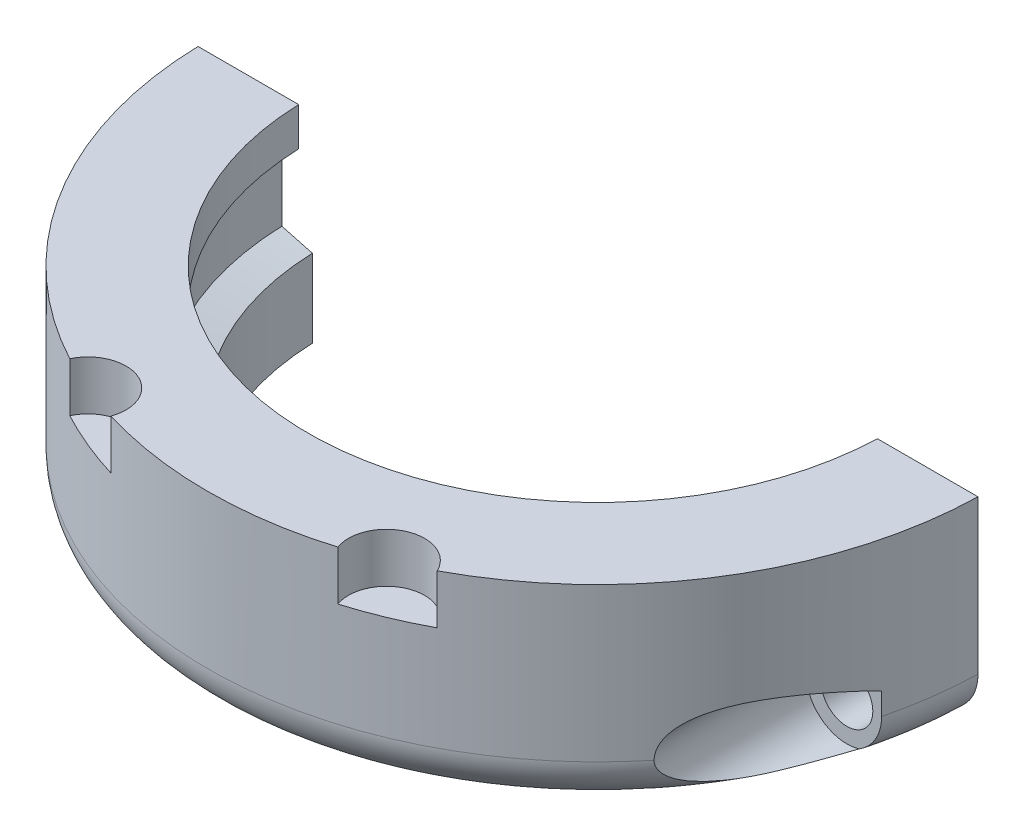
ISO-10303-21;
HEADER;
FILE_DESCRIPTION(('STEP AP214'),'2;1');
FILE_NAME('part.step','',(''),(''),'','','');
FILE_SCHEMA(('AUTOMOTIVE_DESIGN { 1 0 10303 214 1 1 1 1 }'));
ENDSEC;
DATA;
#1=APPLICATION_CONTEXT('core data for automotive mechanical design processes');
#2=APPLICATION_PROTOCOL_DEFINITION('international standard','automotive_design',2000,#1);
#3=PRODUCT_CONTEXT('',#1,'mechanical');
#4=PRODUCT('Part','Part','',(#3));
#5=PRODUCT_RELATED_PRODUCT_CATEGORY('part','',(#4));
#6=PRODUCT_DEFINITION_FORMATION('','',#4);
#7=PRODUCT_DEFINITION_CONTEXT('part definition',#1,'design');
#8=PRODUCT_DEFINITION('design','',#6,#7);
#9=PRODUCT_DEFINITION_SHAPE('','',#8);
#10=(LENGTH_UNIT() NAMED_UNIT(*) SI_UNIT(.MILLI.,.METRE.));
#11=(NAMED_UNIT(*) PLANE_ANGLE_UNIT() SI_UNIT($,.RADIAN.));
#12=(NAMED_UNIT(*) SI_UNIT($,.STERADIAN.) SOLID_ANGLE_UNIT());
#13=UNCERTAINTY_MEASURE_WITH_UNIT(LENGTH_MEASURE(1.E-05),#10,'distance_accuracy_value','');
#14=(GEOMETRIC_REPRESENTATION_CONTEXT(3) GLOBAL_UNCERTAINTY_ASSIGNED_CONTEXT((#13)) GLOBAL_UNIT_ASSIGNED_CONTEXT((#10,
#11,#12)) REPRESENTATION_CONTEXT('',''));
#15=CARTESIAN_POINT('',(0.,0.,0.));
#16=DIRECTION('',(0.,0.,1.));
#17=DIRECTION('',(1.,0.,0.));
#18=AXIS2_PLACEMENT_3D('',#15,#16,#17);
#19=CARTESIAN_POINT('',(0.,3.8608,0.));
#20=DIRECTION('',(0.,-1.,0.));
#21=DIRECTION('',(0.,0.,-1.));
#22=AXIS2_PLACEMENT_3D('',#19,#20,#21);
#23=TOROIDAL_SURFACE('',#22,28.6512,3.8608);
#24=CARTESIAN_POINT('',(-31.3516769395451,1.11162457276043,0.8001));
#25=CARTESIAN_POINT('',(-31.5061060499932,1.26385546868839,0.8001));
#26=CARTESIAN_POINT('',(-31.6477944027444,1.42923576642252,0.8001));
#27=CARTESIAN_POINT('',(-31.9015102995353,1.78157591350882,0.8001));
#28=CARTESIAN_POINT('',(-32.0135020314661,1.96856143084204,0.8001));
#29=CARTESIAN_POINT('',(-32.2044516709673,2.35861420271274,0.8001));
#30=CARTESIAN_POINT('',(-32.2834249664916,2.56167391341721,0.8001));
#31=CARTESIAN_POINT('',(-32.4061297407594,2.97811595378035,0.8001));
#32=CARTESIAN_POINT('',(-32.4498699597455,3.1914957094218,0.8001));
#33=CARTESIAN_POINT('',(-32.5009020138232,3.6225591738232,0.8001));
#34=CARTESIAN_POINT('',(-32.5081958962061,3.84024264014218,0.8001));
#35=CARTESIAN_POINT('',(-32.4861313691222,4.2737521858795,0.8001));
#36=CARTESIAN_POINT('',(-32.4567715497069,4.48957819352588,0.8001));
#37=CARTESIAN_POINT('',(-32.3622366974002,4.91321859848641,0.8001));
#38=CARTESIAN_POINT('',(-32.2970647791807,5.12103369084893,0.8001));
#39=CARTESIAN_POINT('',(-32.132760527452,5.52277405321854,0.8001));
#40=CARTESIAN_POINT('',(-32.0336282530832,5.71669934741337,0.8001));
#41=CARTESIAN_POINT('',(-31.8042076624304,6.0851795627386,0.8001));
#42=CARTESIAN_POINT('',(-31.6739159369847,6.2597323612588,0.8001));
#43=CARTESIAN_POINT('',(-31.3858839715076,6.58449297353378,0.8001));
#44=CARTESIAN_POINT('',(-31.2281437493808,6.73470080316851,0.8001));
#45=CARTESIAN_POINT('',(-30.8896501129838,7.00654993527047,0.8001));
#46=CARTESIAN_POINT('',(-30.7088908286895,7.12818392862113,0.8001));
#47=CARTESIAN_POINT('',(-30.329522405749,7.33939029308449,0.8001));
#48=CARTESIAN_POINT('',(-30.1309132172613,7.42896257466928,0.8001));
#49=CARTESIAN_POINT('',(-29.7214134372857,7.57353366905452,0.8001));
#50=CARTESIAN_POINT('',(-29.5105188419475,7.62852114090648,0.8001));
#51=CARTESIAN_POINT('',(-29.0824924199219,7.70232060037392,0.8001));
#52=CARTESIAN_POINT('',(-28.8653605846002,7.72113253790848,0.8001));
#53=CARTESIAN_POINT('',(-28.4309572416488,7.72205034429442,0.8001));
#54=CARTESIAN_POINT('',(-28.2136857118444,7.70414574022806,0.8001));
#55=CARTESIAN_POINT('',(-27.7852311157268,7.63211822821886,0.8001));
#56=CARTESIAN_POINT('',(-27.5740480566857,7.57799527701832,0.8001));
#57=CARTESIAN_POINT('',(-27.163742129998,7.43505748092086,0.8001));
#58=CARTESIAN_POINT('',(-26.9646205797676,7.34623885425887,0.8001));
#59=CARTESIAN_POINT('',(-26.5841181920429,7.13642750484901,0.8001));
#60=CARTESIAN_POINT('',(-26.4027373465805,7.01543479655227,0.8001));
#61=CARTESIAN_POINT('',(-26.0628989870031,6.74472769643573,0.8001));
#62=CARTESIAN_POINT('',(-25.9044377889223,6.59501792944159,0.8001));
#63=CARTESIAN_POINT('',(-25.6149110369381,6.27111034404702,0.8001));
#64=CARTESIAN_POINT('',(-25.4838454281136,6.09691257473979,0.8001));
#65=CARTESIAN_POINT('',(-25.2528886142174,5.72904874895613,0.8001));
#66=CARTESIAN_POINT('',(-25.1529847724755,5.53539062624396,0.8001));
#67=CARTESIAN_POINT('',(-24.987124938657,5.13404511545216,0.8001));
#68=CARTESIAN_POINT('',(-24.9211688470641,4.9263577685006,0.8001));
#69=CARTESIAN_POINT('',(-24.8251070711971,4.50295320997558,0.8001));
#70=CARTESIAN_POINT('',(-24.7949847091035,4.28723978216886,0.8001));
#71=CARTESIAN_POINT('',(-24.7713930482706,3.85381794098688,0.8001));
#72=CARTESIAN_POINT('',(-24.7779236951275,3.63610953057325,0.8001));
#73=CARTESIAN_POINT('',(-24.8274453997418,3.20493660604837,0.8001));
#74=CARTESIAN_POINT('',(-24.8704271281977,2.99147102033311,0.8001));
#75=CARTESIAN_POINT('',(-24.9916142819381,2.57478465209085,0.8001));
#76=CARTESIAN_POINT('',(-25.0698196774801,2.3715638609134,0.8001));
#77=CARTESIAN_POINT('',(-25.2592394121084,1.98110811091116,0.8001));
#78=CARTESIAN_POINT('',(-25.3704575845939,1.7938750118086,0.8001));
#79=CARTESIAN_POINT('',(-25.6227370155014,1.44072771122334,0.8001));
#80=CARTESIAN_POINT('',(-25.7637983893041,1.27481359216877,0.8001));
#81=CARTESIAN_POINT('',(-26.0718208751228,0.968940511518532,0.8001));
#82=CARTESIAN_POINT('',(-26.2387926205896,0.828992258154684,0.8001));
#83=CARTESIAN_POINT('',(-26.593852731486,0.579098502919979,0.8001));
#84=CARTESIAN_POINT('',(-26.7819411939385,0.469153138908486,0.8001));
#85=CARTESIAN_POINT('',(-27.1739920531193,0.282333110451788,0.8001));
#86=CARTESIAN_POINT('',(-27.3779619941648,0.205474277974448,0.8001));
#87=CARTESIAN_POINT('',(-27.7959006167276,0.0870839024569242,0.8001));
#88=CARTESIAN_POINT('',(-28.0098689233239,0.0455510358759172,0.8001));
#89=CARTESIAN_POINT('',(-28.4417757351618,-0.00102014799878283,0.8001));
#90=CARTESIAN_POINT('',(-28.6597148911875,-0.00605242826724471,0.8001));
#91=CARTESIAN_POINT('',(-29.0934040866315,0.0205461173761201,0.8001));
#92=CARTESIAN_POINT('',(-29.309153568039,0.0521860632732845,0.8001));
#93=CARTESIAN_POINT('',(-29.7323586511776,0.151255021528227,0.8001));
#94=CARTESIAN_POINT('',(-29.9398103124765,0.218700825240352,0.8001));
#95=CARTESIAN_POINT('',(-30.3402541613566,0.387443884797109,0.8001));
#96=CARTESIAN_POINT('',(-30.5332634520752,0.488700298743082,0.8001));
#97=CARTESIAN_POINT('',(-30.8307217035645,0.678260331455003,0.8001));
#98=CARTESIAN_POINT('',(-30.9412532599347,0.757198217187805,0.8001));
#99=CARTESIAN_POINT('',(-31.1534119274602,0.926249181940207,0.8001));
#100=CARTESIAN_POINT('',(-31.2550390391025,1.0163622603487,0.8001));
#101=CARTESIAN_POINT('',(-31.3516769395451,1.11162457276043,0.8001));
#102=B_SPLINE_CURVE_WITH_KNOTS('',3,(#24,#25,#26,#27,#28,#29,#30,#31,#32,#33,#34,#35,#36,#37,
#38,#39,#40,#41,#42,#43,#44,#45,#46,#47,#48,#49,#50,#51,#52,#53,#54,#55,#56,#57,#58,#59,#60,#61,
#62,#63,#64,#65,#66,#67,#68,#69,#70,#71,#72,#73,#74,#75,#76,#77,#78,#79,#80,#81,#82,#83,#84,#85,
#86,#87,#88,#89,#90,#91,#92,#93,#94,#95,#96,#97,#98,#99,#100,#101),.UNSPECIFIED.,.T.,.F.,(4,2,2,
2,2,2,2,2,2,2,2,2,2,2,2,2,2,2,2,2,2,2,2,2,2,2,2,2,2,2,2,2,2,2,2,2,2,2,4),(0.,0.650045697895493,
1.30087177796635,1.95139420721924,2.60175521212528,3.25207968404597,3.90242917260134,
4.55272210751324,5.20301390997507,5.85337689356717,6.50373945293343,7.15426819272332,
7.8047987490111,8.45554251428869,9.10628718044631,9.75721748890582,10.4081485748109,
11.0591506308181,11.7101523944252,12.3610494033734,13.0119451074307,13.6625765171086,
14.3132060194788,14.9635325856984,15.6138581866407,16.2640173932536,16.9141760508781,
17.5644102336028,18.21464693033,18.8651511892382,19.5156584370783,20.1664766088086,
20.817270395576,21.4681718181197,22.1192351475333,22.7706040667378,23.4211889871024,
23.8279714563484,24.23475390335),.UNSPECIFIED.);
#103=CARTESIAN_POINT('',(-28.6400262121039,0.,0.8001));
#104=VERTEX_POINT('',#103);
#105=CARTESIAN_POINT('',(-32.5021535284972,3.86080000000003,0.8001));
#106=VERTEX_POINT('',#105);
#107=EDGE_CURVE('E152',#104,#106,#102,.T.);
#108=ORIENTED_EDGE('',*,*,#107,.F.);
#109=CARTESIAN_POINT('',(0.,0.,0.));
#110=DIRECTION('',(0.,-1.,0.));
#111=DIRECTION('',(0.,0.,-1.));
#112=AXIS2_PLACEMENT_3D('',#109,#110,#111);
#113=CIRCLE('',#112,28.6512);
#114=CARTESIAN_POINT('',(28.6400262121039,0.,0.8001));
#115=VERTEX_POINT('',#114);
#116=EDGE_CURVE('E358',#115,#104,#113,.T.);
#117=ORIENTED_EDGE('',*,*,#116,.F.);
#118=CARTESIAN_POINT('',(25.7604678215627,1.28764851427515,0.8001));
#119=CARTESIAN_POINT('',(25.6159223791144,1.44927253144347,0.8001));
#120=CARTESIAN_POINT('',(25.4849160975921,1.62321643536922,0.8001));
#121=CARTESIAN_POINT('',(25.253857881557,1.99077491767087,0.8001));
#122=CARTESIAN_POINT('',(25.1538432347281,2.18441282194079,0.8001));
#123=CARTESIAN_POINT('',(24.987791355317,2.58566425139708,0.8001));
#124=CARTESIAN_POINT('',(24.9217385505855,2.79327132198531,0.8001));
#125=CARTESIAN_POINT('',(24.8254561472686,3.21657334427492,0.8001));
#126=CARTESIAN_POINT('',(24.7952176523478,3.43226627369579,0.8001));
#127=CARTESIAN_POINT('',(24.7713923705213,3.86563042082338,0.8001));
#128=CARTESIAN_POINT('',(24.7777992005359,4.08330128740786,0.8001));
#129=CARTESIAN_POINT('',(24.8270695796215,4.51448521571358,0.8001));
#130=CARTESIAN_POINT('',(24.8699345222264,4.72799811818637,0.8001));
#131=CARTESIAN_POINT('',(24.9908955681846,5.1447768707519,0.8001));
#132=CARTESIAN_POINT('',(25.0689883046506,5.34804369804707,0.8001));
#133=CARTESIAN_POINT('',(25.2581812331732,5.73858659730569,0.8001));
#134=CARTESIAN_POINT('',(25.3692814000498,5.92586268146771,0.8001));
#135=CARTESIAN_POINT('',(25.6213672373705,6.27916855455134,0.8001));
#136=CARTESIAN_POINT('',(25.7623615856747,6.44519215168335,0.8001));
#137=CARTESIAN_POINT('',(26.070209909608,6.75122562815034,0.8001));
#138=CARTESIAN_POINT('',(26.237063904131,6.89123548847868,0.8001));
#139=CARTESIAN_POINT('',(26.5919797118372,7.14133729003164,0.8001));
#140=CARTESIAN_POINT('',(26.7800514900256,7.25141509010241,0.8001));
#141=CARTESIAN_POINT('',(27.1720009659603,7.43844812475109,0.8001));
#142=CARTESIAN_POINT('',(27.3758787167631,7.5154032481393,0.8001));
#143=CARTESIAN_POINT('',(27.7937375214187,7.63403437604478,0.8001));
#144=CARTESIAN_POINT('',(28.0077224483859,7.67569673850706,0.8001));
#145=CARTESIAN_POINT('',(28.4396495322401,7.72251048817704,0.8001));
#146=CARTESIAN_POINT('',(28.6575916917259,7.72766185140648,0.8001));
#147=CARTESIAN_POINT('',(29.0912769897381,7.70130396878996,0.8001));
#148=CARTESIAN_POINT('',(29.3070198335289,7.66978987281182,0.8001));
#149=CARTESIAN_POINT('',(29.7301512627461,7.57098406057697,0.8001));
#150=CARTESIAN_POINT('',(29.9375398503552,7.50369235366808,0.8001));
#151=CARTESIAN_POINT('',(30.338045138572,7.33524853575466,0.8001));
#152=CARTESIAN_POINT('',(30.5311637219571,7.2341009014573,0.8001));
#153=CARTESIAN_POINT('',(30.8976718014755,7.0008102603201,0.8001));
#154=CARTESIAN_POINT('',(31.0710613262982,6.86866729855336,0.8001));
#155=CARTESIAN_POINT('',(31.3931340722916,6.57717835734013,0.8001));
#156=CARTESIAN_POINT('',(31.5418245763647,6.41784042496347,0.8001));
#157=CARTESIAN_POINT('',(31.8103340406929,6.07645607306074,0.8001));
#158=CARTESIAN_POINT('',(31.9301530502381,5.89440969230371,0.8001));
#159=CARTESIAN_POINT('',(32.1374775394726,5.51283996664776,0.8001));
#160=CARTESIAN_POINT('',(32.2249935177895,5.31332232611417,0.8001));
#161=CARTESIAN_POINT('',(32.3652778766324,4.90242394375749,0.8001));
#162=CARTESIAN_POINT('',(32.4180463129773,4.69104322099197,0.8001));
#163=CARTESIAN_POINT('',(32.4873261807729,4.26247427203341,0.8001));
#164=CARTESIAN_POINT('',(32.5038464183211,4.04528746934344,0.8001));
#165=CARTESIAN_POINT('',(32.5001862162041,3.61122334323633,0.8001));
#166=CARTESIAN_POINT('',(32.4800057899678,3.394346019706,0.8001));
#167=CARTESIAN_POINT('',(32.4035216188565,2.96707772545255,0.8001));
#168=CARTESIAN_POINT('',(32.3472211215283,2.75668617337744,0.8001));
#169=CARTESIAN_POINT('',(32.2001004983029,2.34834036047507,0.8001));
#170=CARTESIAN_POINT('',(32.1092804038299,2.15038608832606,0.8001));
#171=CARTESIAN_POINT('',(31.8956924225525,1.77251455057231,0.8001));
#172=CARTESIAN_POINT('',(31.7729217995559,1.59259883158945,0.8001));
#173=CARTESIAN_POINT('',(31.4989243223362,1.25592588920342,0.8001));
#174=CARTESIAN_POINT('',(31.3476973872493,1.09916873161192,0.8001));
#175=CARTESIAN_POINT('',(31.0210428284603,0.813222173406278,0.8001));
#176=CARTESIAN_POINT('',(30.8456094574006,0.684039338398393,0.8001));
#177=CARTESIAN_POINT('',(30.4755501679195,0.456948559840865,0.8001));
#178=CARTESIAN_POINT('',(30.2809241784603,0.359040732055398,0.8001));
#179=CARTESIAN_POINT('',(29.8779336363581,0.197244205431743,0.8001));
#180=CARTESIAN_POINT('',(29.6695643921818,0.133367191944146,0.8001));
#181=CARTESIAN_POINT('',(29.2450688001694,0.041493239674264,0.8001));
#182=CARTESIAN_POINT('',(29.0289427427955,0.0134949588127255,0.8001));
#183=CARTESIAN_POINT('',(28.5950162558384,-0.00583860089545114,0.8001));
#184=CARTESIAN_POINT('',(28.3772155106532,0.00283320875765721,0.8001));
#185=CARTESIAN_POINT('',(27.9461010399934,0.0566202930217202,0.8001));
#186=CARTESIAN_POINT('',(27.7327884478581,0.101744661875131,0.8001));
#187=CARTESIAN_POINT('',(27.3166542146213,0.227188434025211,0.8001));
#188=CARTESIAN_POINT('',(27.1138391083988,0.307529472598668,0.8001));
#189=CARTESIAN_POINT('',(26.7247635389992,0.501085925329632,0.8001));
#190=CARTESIAN_POINT('',(26.538483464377,0.614261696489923,0.8001));
#191=CARTESIAN_POINT('',(26.2534416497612,0.822164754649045,0.8001));
#192=CARTESIAN_POINT('',(26.1480263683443,0.907932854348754,0.8001));
#193=CARTESIAN_POINT('',(25.9467938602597,1.0900733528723,0.8001));
#194=CARTESIAN_POINT('',(25.8509766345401,1.18644575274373,0.8001));
#195=CARTESIAN_POINT('',(25.7604678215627,1.28764851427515,0.8001));
#196=B_SPLINE_CURVE_WITH_KNOTS('',3,(#118,#119,#120,#121,#122,#123,#124,#125,#126,#127,#128,
#129,#130,#131,#132,#133,#134,#135,#136,#137,#138,#139,#140,#141,#142,#143,#144,#145,#146,#147,
#148,#149,#150,#151,#152,#153,#154,#155,#156,#157,#158,#159,#160,#161,#162,#163,#164,#165,#166,
#167,#168,#169,#170,#171,#172,#173,#174,#175,#176,#177,#178,#179,#180,#181,#182,#183,#184,#185,
#186,#187,#188,#189,#190,#191,#192,#193,#194,#195),.UNSPECIFIED.,.T.,.F.,(4,2,2,2,2,2,2,2,2,2,2,
2,2,2,2,2,2,2,2,2,2,2,2,2,2,2,2,2,2,2,2,2,2,2,2,2,2,2,4),(0.,0.64999789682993,1.30077483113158,
1.95125310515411,2.60156976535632,3.25177315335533,3.90200139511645,4.55216750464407,
5.20233311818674,5.85268772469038,6.50304280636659,7.15370461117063,7.80436860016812,
8.45528398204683,9.1061997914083,9.75720171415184,10.4082034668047,11.0591191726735,
11.7100339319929,12.360756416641,13.0114777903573,13.6619874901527,14.3124961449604,
14.962846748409,15.6131971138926,16.2634890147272,16.9137803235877,17.5641273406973,
18.214476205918,18.8649797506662,19.5154857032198,20.1662148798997,20.8169197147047,
21.4677503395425,22.1187433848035,22.7701369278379,23.4207472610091,23.8277509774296,
24.2347547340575),.UNSPECIFIED.);
#197=CARTESIAN_POINT('',(32.5021535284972,3.86080000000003,0.8001));
#198=VERTEX_POINT('',#197);
#199=EDGE_CURVE('E157',#198,#115,#196,.T.);
#200=ORIENTED_EDGE('',*,*,#199,.F.);
#201=CARTESIAN_POINT('',(0.,3.86080000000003,0.));
#202=DIRECTION('',(0.,-1.,0.));
#203=DIRECTION('',(0.,0.,-1.));
#204=AXIS2_PLACEMENT_3D('',#201,#202,#203);
#205=CIRCLE('',#204,32.512);
#206=CARTESIAN_POINT('',(31.5441003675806,3.86080000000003,7.874));
#207=VERTEX_POINT('',#206);
#208=EDGE_CURVE('E181',#198,#207,#205,.T.);
#209=ORIENTED_EDGE('',*,*,#208,.T.);
#210=CARTESIAN_POINT('',(25.0620449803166,6.89972011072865,7.874));
#211=CARTESIAN_POINT('',(24.9742006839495,6.83405926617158,7.874));
#212=CARTESIAN_POINT('',(24.8890309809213,6.76481371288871,7.874));
#213=CARTESIAN_POINT('',(24.7246397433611,6.61956023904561,7.874));
#214=CARTESIAN_POINT('',(24.645419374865,6.54355099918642,7.874));
#215=CARTESIAN_POINT('',(24.4934624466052,6.38510084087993,7.874));
#216=CARTESIAN_POINT('',(24.4207344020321,6.30265173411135,7.874));
#217=CARTESIAN_POINT('',(24.2824948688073,6.13195715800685,7.874));
#218=CARTESIAN_POINT('',(24.2169828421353,6.04371212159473,7.874));
#219=CARTESIAN_POINT('',(24.0319192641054,5.77075373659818,7.874));
#220=CARTESIAN_POINT('',(23.9239661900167,5.5779481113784,7.874));
#221=CARTESIAN_POINT('',(23.7434723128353,5.17670641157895,7.874));
#222=CARTESIAN_POINT('',(23.6708971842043,4.96828571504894,7.874));
#223=CARTESIAN_POINT('',(23.5657071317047,4.54915789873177,7.874));
#224=CARTESIAN_POINT('',(23.5318073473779,4.33877422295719,7.874));
#225=CARTESIAN_POINT('',(23.5009376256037,3.91527292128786,7.874));
#226=CARTESIAN_POINT('',(23.503972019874,3.70215497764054,7.874));
#227=CARTESIAN_POINT('',(23.5462437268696,3.28561947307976,7.874));
#228=CARTESIAN_POINT('',(23.5844628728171,3.08209751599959,7.874));
#229=CARTESIAN_POINT('',(23.6942096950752,2.68429143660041,7.874));
#230=CARTESIAN_POINT('',(23.7657339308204,2.49000636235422,7.874));
#231=CARTESIAN_POINT('',(23.9403867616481,2.11394593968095,7.874));
#232=CARTESIAN_POINT('',(24.0438144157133,1.93230979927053,7.874));
#233=CARTESIAN_POINT('',(24.2785846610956,1.58807308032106,7.874));
#234=CARTESIAN_POINT('',(24.4099360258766,1.42547850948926,7.874));
#235=CARTESIAN_POINT('',(24.709998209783,1.10886178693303,7.874));
#236=CARTESIAN_POINT('',(24.8810517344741,0.957056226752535,7.874));
#237=CARTESIAN_POINT('',(25.246228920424,0.68431946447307,7.874));
#238=CARTESIAN_POINT('',(25.4403612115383,0.563399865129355,7.874));
#239=CARTESIAN_POINT('',(25.8517750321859,0.352229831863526,7.874));
#240=CARTESIAN_POINT('',(26.069563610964,0.262967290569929,7.874));
#241=CARTESIAN_POINT('',(26.5170101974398,0.122247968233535,7.874));
#242=CARTESIAN_POINT('',(26.7466685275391,0.0707922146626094,7.874));
#243=CARTESIAN_POINT('',(27.2113217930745,0.00699806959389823,7.874));
#244=CARTESIAN_POINT('',(27.4463158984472,-0.00534636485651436,7.874));
#245=CARTESIAN_POINT('',(27.9150550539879,0.00956574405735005,7.874));
#246=CARTESIAN_POINT('',(28.1488001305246,0.0368214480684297,7.874));
#247=CARTESIAN_POINT('',(28.608331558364,0.130548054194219,7.874));
#248=CARTESIAN_POINT('',(28.8341175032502,0.197020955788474,7.874));
#249=CARTESIAN_POINT('',(29.2709246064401,0.367796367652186,7.874));
#250=CARTESIAN_POINT('',(29.4819470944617,0.472095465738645,7.874));
#251=CARTESIAN_POINT('',(29.8780024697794,0.713222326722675,7.874));
#252=CARTESIAN_POINT('',(30.0635149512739,0.849261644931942,7.874));
#253=CARTESIAN_POINT('',(30.4080661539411,1.15153798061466,7.874));
#254=CARTESIAN_POINT('',(30.5671097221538,1.31776945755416,7.874));
#255=CARTESIAN_POINT('',(30.8485747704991,1.66979469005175,7.874));
#256=CARTESIAN_POINT('',(30.9720347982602,1.85475809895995,7.874));
#257=CARTESIAN_POINT('',(31.1850218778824,2.24328471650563,7.874));
#258=CARTESIAN_POINT('',(31.2745559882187,2.44684404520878,7.874));
#259=CARTESIAN_POINT('',(31.4144638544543,2.86019814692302,7.874));
#260=CARTESIAN_POINT('',(31.4659302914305,3.06962349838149,7.874));
#261=CARTESIAN_POINT('',(31.5322965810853,3.49420175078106,7.874));
#262=CARTESIAN_POINT('',(31.5471979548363,3.70935441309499,7.874));
#263=CARTESIAN_POINT('',(31.5399918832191,4.13536592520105,7.874));
#264=CARTESIAN_POINT('',(31.5185083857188,4.34623566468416,7.874));
#265=CARTESIAN_POINT('',(31.4404353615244,4.76132004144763,7.874));
#266=CARTESIAN_POINT('',(31.383854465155,4.96553630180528,7.874));
#267=CARTESIAN_POINT('',(31.2374543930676,5.36163632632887,7.874));
#268=CARTESIAN_POINT('',(31.1476351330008,5.55352005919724,7.874));
#269=CARTESIAN_POINT('',(30.9374417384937,5.91998605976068,7.874));
#270=CARTESIAN_POINT('',(30.8170511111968,6.09455891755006,7.874));
#271=CARTESIAN_POINT('',(30.6153987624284,6.34117633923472,7.874));
#272=CARTESIAN_POINT('',(30.5439666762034,6.42146038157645,7.874));
#273=CARTESIAN_POINT('',(30.3947076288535,6.57589474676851,7.874));
#274=CARTESIAN_POINT('',(30.3168802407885,6.65004465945,7.874));
#275=CARTESIAN_POINT('',(30.1554457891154,6.79170213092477,7.874));
#276=CARTESIAN_POINT('',(30.0718401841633,6.8592113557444,7.874));
#277=CARTESIAN_POINT('',(29.8994437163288,6.98722635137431,7.874));
#278=CARTESIAN_POINT('',(29.8106534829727,7.04773296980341,7.874));
#279=CARTESIAN_POINT('',(29.719566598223,7.10455540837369,7.874));
#280=B_SPLINE_CURVE_WITH_KNOTS('',3,(#210,#211,#212,#213,#214,#215,#216,#217,#218,#219,#220,
#221,#222,#223,#224,#225,#226,#227,#228,#229,#230,#231,#232,#233,#234,#235,#236,#237,#238,#239,
#240,#241,#242,#243,#244,#245,#246,#247,#248,#249,#250,#251,#252,#253,#254,#255,#256,#257,#258,
#259,#260,#261,#262,#263,#264,#265,#266,#267,#268,#269,#270,#271,#272,#273,#274,#275,#276,#277,
#278,#279),.UNSPECIFIED.,.F.,.F.,(4,2,2,2,2,2,2,2,2,2,2,2,2,2,2,2,2,2,2,2,2,2,2,2,2,2,2,2,2,2,2,
2,2,2,4),(0.,0.328929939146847,0.657924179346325,0.987343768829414,1.31673878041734,
1.97606706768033,2.63475436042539,3.27085603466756,3.90703231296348,4.52535881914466,
5.14362146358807,5.76786542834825,6.39230581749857,7.07502923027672,7.75800874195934,
8.46073652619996,9.16348340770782,9.86612170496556,10.5687451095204,11.2714043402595,
11.9740002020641,12.6607169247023,13.3473077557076,14.0111564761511,14.6748670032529,
15.3186966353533,15.9624994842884,16.5953734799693,17.2280919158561,17.8608119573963,
18.4938740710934,18.8159583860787,19.1380642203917,19.4600890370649,19.7820748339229),.UNSPECIFIED.);
#281=CARTESIAN_POINT('',(29.670101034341,0.586676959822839,7.874));
#282=VERTEX_POINT('',#281);
#283=EDGE_CURVE('E208',#207,#282,#280,.F.);
#284=ORIENTED_EDGE('',*,*,#283,.T.);
#285=CARTESIAN_POINT('',(29.6702105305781,0.586711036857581,7.8738));
#286=CARTESIAN_POINT('',(29.6242511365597,0.572419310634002,7.95774455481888));
#287=CARTESIAN_POINT('',(29.5794207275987,0.559515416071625,8.04252232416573));
#288=CARTESIAN_POINT('',(29.4918684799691,0.53613597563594,8.21345500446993));
#289=CARTESIAN_POINT('',(29.4491459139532,0.525659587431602,8.2996094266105));
#290=CARTESIAN_POINT('',(29.3656900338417,0.506792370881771,8.47293648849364));
#291=CARTESIAN_POINT('',(29.3249538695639,0.498398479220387,8.56010743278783));
#292=CARTESIAN_POINT('',(29.2452190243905,0.483400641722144,8.73539909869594));
#293=CARTESIAN_POINT('',(29.2062205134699,0.476796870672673,8.8235199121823));
#294=CARTESIAN_POINT('',(29.091835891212,0.459353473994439,9.08840482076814));
#295=CARTESIAN_POINT('',(29.018761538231,0.450817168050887,9.26632085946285));
#296=CARTESIAN_POINT('',(28.8774306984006,0.438537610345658,9.62427385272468));
#297=CARTESIAN_POINT('',(28.8091763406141,0.434796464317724,9.80431170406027));
#298=CARTESIAN_POINT('',(28.6764960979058,0.43125284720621,10.1654040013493));
#299=CARTESIAN_POINT('',(28.6120626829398,0.431442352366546,10.3464556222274));
#300=CARTESIAN_POINT('',(28.4859379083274,0.435204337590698,10.7094382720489));
#301=CARTESIAN_POINT('',(28.4242461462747,0.438776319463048,10.8913691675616));
#302=CARTESIAN_POINT('',(28.3027709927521,0.449003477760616,11.2559711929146));
#303=CARTESIAN_POINT('',(28.2429894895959,0.455661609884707,11.438642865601));
#304=CARTESIAN_POINT('',(28.1247829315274,0.471923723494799,11.804296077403));
#305=CARTESIAN_POINT('',(28.066357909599,0.481527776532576,11.9872776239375));
#306=CARTESIAN_POINT('',(27.9334621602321,0.506889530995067,12.4067117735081));
#307=CARTESIAN_POINT('',(27.8592804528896,0.523624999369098,12.6431974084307));
#308=CARTESIAN_POINT('',(27.711575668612,0.562169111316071,13.1158780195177));
#309=CARTESIAN_POINT('',(27.6380523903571,0.583976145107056,13.3520730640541));
#310=CARTESIAN_POINT('',(27.4910765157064,0.633082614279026,13.8238462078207));
#311=CARTESIAN_POINT('',(27.4176239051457,0.660380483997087,14.0594244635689));
#312=CARTESIAN_POINT('',(27.2703583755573,0.721110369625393,14.5296867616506));
#313=CARTESIAN_POINT('',(27.1965454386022,0.754542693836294,14.7643707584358));
#314=CARTESIAN_POINT('',(27.0186447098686,0.84313442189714,15.3260384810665));
#315=CARTESIAN_POINT('',(26.9142490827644,0.901636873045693,15.6524190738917));
#316=CARTESIAN_POINT('',(26.7564588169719,1.00215312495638,16.1392040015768));
#317=CARTESIAN_POINT('',(26.7036259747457,1.03781446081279,16.3011113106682));
#318=CARTESIAN_POINT('',(26.5976074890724,1.11397132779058,16.6236731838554));
#319=CARTESIAN_POINT('',(26.5444218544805,1.15446673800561,16.7843277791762));
#320=CARTESIAN_POINT('',(26.4336238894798,1.24433765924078,17.116454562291));
#321=CARTESIAN_POINT('',(26.3759881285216,1.29415828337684,17.2877994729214));
#322=CARTESIAN_POINT('',(26.2605472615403,1.40132279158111,17.6280576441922));
#323=CARTESIAN_POINT('',(26.2027421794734,1.45866565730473,17.7969712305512));
#324=CARTESIAN_POINT('',(26.087375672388,1.58220879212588,18.1311457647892));
#325=CARTESIAN_POINT('',(26.0298139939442,1.64838794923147,18.2964143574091));
#326=CARTESIAN_POINT('',(25.9153051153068,1.79165796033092,18.6223205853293));
#327=CARTESIAN_POINT('',(25.8583575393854,1.86874168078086,18.7829611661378));
#328=CARTESIAN_POINT('',(25.7582276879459,2.01825651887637,19.0630064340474));
#329=CARTESIAN_POINT('',(25.7147640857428,2.08800430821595,19.1837320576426));
#330=CARTESIAN_POINT('',(25.6293237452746,2.23791017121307,19.4195261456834));
#331=CARTESIAN_POINT('',(25.587349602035,2.31808537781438,19.5345848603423));
#332=CARTESIAN_POINT('',(25.5057473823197,2.49203363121,19.7569231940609));
#333=CARTESIAN_POINT('',(25.4661454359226,2.58592883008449,19.864118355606));
#334=CARTESIAN_POINT('',(25.3919011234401,2.7899361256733,20.0640019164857));
#335=CARTESIAN_POINT('',(25.3572441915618,2.89999857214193,20.1567329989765));
#336=CARTESIAN_POINT('',(25.310168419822,3.08605184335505,20.2821818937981));
#337=CARTESIAN_POINT('',(25.29469694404,3.15555586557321,20.3232938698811));
#338=CARTESIAN_POINT('',(25.2675467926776,3.30016195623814,20.3953101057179));
#339=CARTESIAN_POINT('',(25.2558539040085,3.3752417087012,20.4262526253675));
#340=CARTESIAN_POINT('',(25.2387422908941,3.5180315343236,20.4714858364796));
#341=CARTESIAN_POINT('',(25.2326284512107,3.58505859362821,20.4876236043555));
#342=CARTESIAN_POINT('',(25.2264171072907,3.68733266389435,20.5040129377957));
#343=CARTESIAN_POINT('',(25.2248395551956,3.72189274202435,20.5081740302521));
#344=CARTESIAN_POINT('',(25.2227279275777,3.79129619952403,20.5137430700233));
#345=CARTESIAN_POINT('',(25.2221947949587,3.82613980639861,20.5151485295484));
#346=CARTESIAN_POINT('',(25.2222000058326,3.86100000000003,20.5151351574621));
#347=B_SPLINE_CURVE_WITH_KNOTS('',3,(#285,#286,#287,#288,#289,#290,#291,#292,#293,#294,#295,
#296,#297,#298,#299,#300,#301,#302,#303,#304,#305,#306,#307,#308,#309,#310,#311,#312,#313,#314,
#315,#316,#317,#318,#319,#320,#321,#322,#323,#324,#325,#326,#327,#328,#329,#330,#331,#332,#333,
#334,#335,#336,#337,#338,#339,#340,#341,#342,#343,#344,#345,#346),.UNSPECIFIED.,.F.,.F.,(4,2,2,
2,2,2,2,2,2,2,2,2,2,2,2,2,2,2,2,2,2,2,2,2,2,2,2,2,2,2,4),(0.,0.290244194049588,
0.580387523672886,0.870101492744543,1.15984373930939,1.73723089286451,2.31487151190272,
2.89133309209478,3.46770978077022,4.044639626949,4.62158348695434,5.36676531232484,
6.111710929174,6.85644443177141,7.60121537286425,8.64368843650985,9.16564081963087,
9.68758015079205,10.2499960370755,10.8123358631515,11.3733553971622,11.9340096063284,
12.3717797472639,12.8102784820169,13.2529505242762,13.6942904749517,13.940249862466,
14.1852730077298,14.3919880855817,14.4964105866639,14.6009273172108),.UNSPECIFIED.);
#348=CARTESIAN_POINT('',(25.2222,3.86080000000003,20.5151351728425));
#349=VERTEX_POINT('',#348);
#350=EDGE_CURVE('E200',#282,#349,#347,.T.);
#351=ORIENTED_EDGE('',*,*,#350,.T.);
#352=CARTESIAN_POINT('',(-25.2222,3.86080000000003,20.5151351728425));
#353=VERTEX_POINT('',#352);
#354=EDGE_CURVE('E179',#349,#353,#205,.T.);
#355=ORIENTED_EDGE('',*,*,#354,.T.);
#356=CARTESIAN_POINT('',(-25.2222000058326,3.86100000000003,20.5151351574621));
#357=CARTESIAN_POINT('',(-25.2221928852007,3.82242822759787,20.5151533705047));
#358=CARTESIAN_POINT('',(-25.2228468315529,3.78387943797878,20.5134295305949));
#359=CARTESIAN_POINT('',(-25.2254294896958,3.70717205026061,20.5066180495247));
#360=CARTESIAN_POINT('',(-25.2273565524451,3.66901301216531,20.5015347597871));
#361=CARTESIAN_POINT('',(-25.2349112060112,3.5564978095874,20.481598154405));
#362=CARTESIAN_POINT('',(-25.2423149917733,3.48305775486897,20.4620511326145));
#363=CARTESIAN_POINT('',(-25.263396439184,3.32339317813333,20.4062952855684));
#364=CARTESIAN_POINT('',(-25.2781552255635,3.2383458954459,20.3672085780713));
#365=CARTESIAN_POINT('',(-25.3122385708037,3.07572534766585,20.2766737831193));
#366=CARTESIAN_POINT('',(-25.3315876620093,2.99819550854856,20.2251592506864));
#367=CARTESIAN_POINT('',(-25.3698220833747,2.86349409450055,20.1230126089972));
#368=CARTESIAN_POINT('',(-25.3882150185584,2.80511427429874,20.0737520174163));
#369=CARTESIAN_POINT('',(-25.4266026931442,2.69310090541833,19.9706263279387));
#370=CARTESIAN_POINT('',(-25.4465985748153,2.63947079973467,19.916757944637));
#371=CARTESIAN_POINT('',(-25.4877778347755,2.53645845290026,19.8054617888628));
#372=CARTESIAN_POINT('',(-25.5089623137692,2.48708026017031,19.7480307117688));
#373=CARTESIAN_POINT('',(-25.5521919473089,2.39215881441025,19.6304381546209));
#374=CARTESIAN_POINT('',(-25.5742368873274,2.34661461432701,19.5702773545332));
#375=CARTESIAN_POINT('',(-25.6259822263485,2.24516211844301,19.428569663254));
#376=CARTESIAN_POINT('',(-25.6559158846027,2.19048116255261,19.3462312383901));
#377=CARTESIAN_POINT('',(-25.7165381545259,2.08613626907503,19.1786862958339));
#378=CARTESIAN_POINT('',(-25.7472270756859,2.03647443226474,19.0934785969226));
#379=CARTESIAN_POINT('',(-25.8401211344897,1.89386726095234,18.8343070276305));
#380=CARTESIAN_POINT('',(-25.9030730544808,1.80745130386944,18.657014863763));
#381=CARTESIAN_POINT('',(-26.0301195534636,1.64756038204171,18.2956542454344));
#382=CARTESIAN_POINT('',(-26.0942189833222,1.57417700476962,18.1115480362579));
#383=CARTESIAN_POINT('',(-26.1904042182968,1.47235126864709,17.8325580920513));
#384=CARTESIAN_POINT('',(-26.2224564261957,1.43979803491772,17.7391356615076));
#385=CARTESIAN_POINT('',(-26.2865373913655,1.37716934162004,17.5514558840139));
#386=CARTESIAN_POINT('',(-26.3185661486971,1.34709387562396,17.4571985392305));
#387=CARTESIAN_POINT('',(-26.405784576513,1.26817520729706,17.1993013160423));
#388=CARTESIAN_POINT('',(-26.4609115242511,1.22155437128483,17.0349588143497));
#389=CARTESIAN_POINT('',(-26.5708483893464,1.13406042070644,16.7046347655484));
#390=CARTESIAN_POINT('',(-26.6256582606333,1.09318812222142,16.5386529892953));
#391=CARTESIAN_POINT('',(-26.7349205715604,1.01644164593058,16.2053297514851));
#392=CARTESIAN_POINT('',(-26.7893728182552,0.980569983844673,16.0379876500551));
#393=CARTESIAN_POINT('',(-26.8978832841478,0.913260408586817,15.7022830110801));
#394=CARTESIAN_POINT('',(-26.9519414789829,0.881822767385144,15.5339204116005));
#395=CARTESIAN_POINT('',(-27.1139004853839,0.793230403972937,15.0265457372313));
#396=CARTESIAN_POINT('',(-27.2212390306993,0.742033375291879,14.6863077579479));
#397=CARTESIAN_POINT('',(-27.4350353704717,0.652625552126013,14.0040235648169));
#398=CARTESIAN_POINT('',(-27.541493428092,0.614410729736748,13.6619779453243));
#399=CARTESIAN_POINT('',(-27.7543201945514,0.549310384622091,12.9788651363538));
#400=CARTESIAN_POINT('',(-27.8606862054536,0.522364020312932,12.6378028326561));
#401=CARTESIAN_POINT('',(-28.0760523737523,0.478586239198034,11.9557196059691));
#402=CARTESIAN_POINT('',(-28.1850534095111,0.461758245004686,11.6146987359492));
#403=CARTESIAN_POINT('',(-28.3528543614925,0.444347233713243,11.1048429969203));
#404=CARTESIAN_POINT('',(-28.4094232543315,0.439849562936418,10.9354039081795));
#405=CARTESIAN_POINT('',(-28.5246203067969,0.433650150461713,10.597178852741));
#406=CARTESIAN_POINT('',(-28.5832483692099,0.431948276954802,10.4283928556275));
#407=CARTESIAN_POINT('',(-28.7032177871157,0.431670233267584,10.0918795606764));
#408=CARTESIAN_POINT('',(-28.7645576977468,0.433092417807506,9.92415175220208));
#409=CARTESIAN_POINT('',(-28.8908057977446,0.439596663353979,9.59012527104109));
#410=CARTESIAN_POINT('',(-28.9557134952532,0.44467822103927,9.42382640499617));
#411=CARTESIAN_POINT('',(-29.0710522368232,0.457256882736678,9.14009599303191));
#412=CARTESIAN_POINT('',(-29.1203752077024,0.463661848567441,9.02216707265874));
#413=CARTESIAN_POINT('',(-29.2217672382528,0.47921410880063,8.78767499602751));
#414=CARTESIAN_POINT('',(-29.2738362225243,0.488361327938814,8.67111180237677));
#415=CARTESIAN_POINT('',(-29.3811531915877,0.509945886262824,8.43972970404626));
#416=CARTESIAN_POINT('',(-29.4364015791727,0.522383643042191,8.32491102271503));
#417=CARTESIAN_POINT('',(-29.5505062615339,0.551314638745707,8.09751477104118));
#418=CARTESIAN_POINT('',(-29.6093648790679,0.56781050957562,7.98493870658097));
#419=CARTESIAN_POINT('',(-29.6702105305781,0.586711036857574,7.8738));
#420=B_SPLINE_CURVE_WITH_KNOTS('',3,(#356,#357,#358,#359,#360,#361,#362,#363,#364,#365,#366,
#367,#368,#369,#370,#371,#372,#373,#374,#375,#376,#377,#378,#379,#380,#381,#382,#383,#384,#385,
#386,#387,#388,#389,#390,#391,#392,#393,#394,#395,#396,#397,#398,#399,#400,#401,#402,#403,#404,
#405,#406,#407,#408,#409,#410,#411,#412,#413,#414,#415,#416,#417,#418,#419),.UNSPECIFIED.,.F.,
.F.,(4,2,2,2,2,2,2,2,2,2,2,2,2,2,2,2,2,2,2,2,2,2,2,2,2,2,2,2,2,2,2,4),(0.,0.115628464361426,
0.231107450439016,0.458976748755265,0.741690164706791,1.02594996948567,1.26132909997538,
1.49687748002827,1.7326477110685,1.96835953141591,2.27797086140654,2.58771124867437,
3.20802484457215,3.83253867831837,4.14449318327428,4.45644687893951,4.99482491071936,
5.53327929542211,6.07200359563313,6.61076092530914,7.69169541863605,8.77229423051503,
9.84698080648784,10.9220306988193,11.4580725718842,11.9940891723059,12.5298235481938,
13.0654842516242,13.449394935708,13.8332950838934,14.2172439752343,14.6014425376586),.UNSPECIFIED.);
#421=CARTESIAN_POINT('',(-29.6701010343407,0.586676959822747,7.874));
#422=VERTEX_POINT('',#421);
#423=EDGE_CURVE('E329',#353,#422,#420,.T.);
#424=ORIENTED_EDGE('',*,*,#423,.T.);
#425=CARTESIAN_POINT('',(-29.6485926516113,7.14782188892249,7.874));
#426=CARTESIAN_POINT('',(-29.7429940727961,7.09162226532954,7.874));
#427=CARTESIAN_POINT('',(-29.8350773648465,7.03151926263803,7.874));
#428=CARTESIAN_POINT('',(-30.0139648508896,6.90389347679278,7.874));
#429=CARTESIAN_POINT('',(-30.1007684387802,6.83636984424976,7.874));
#430=CARTESIAN_POINT('',(-30.2684698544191,6.69427054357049,7.874));
#431=CARTESIAN_POINT('',(-30.3493649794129,6.61969168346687,7.874));
#432=CARTESIAN_POINT('',(-30.50458023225,6.46398586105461,7.874));
#433=CARTESIAN_POINT('',(-30.5789007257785,6.38285926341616,7.874));
#434=CARTESIAN_POINT('',(-30.7204641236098,6.21449012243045,7.874));
#435=CARTESIAN_POINT('',(-30.7876989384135,6.12724077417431,7.874));
#436=CARTESIAN_POINT('',(-30.9144723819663,5.94726831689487,7.874));
#437=CARTESIAN_POINT('',(-30.9740081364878,5.85454318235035,7.874));
#438=CARTESIAN_POINT('',(-31.0848037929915,5.66439517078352,7.874));
#439=CARTESIAN_POINT('',(-31.136071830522,5.566977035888,7.874));
#440=CARTESIAN_POINT('',(-31.229985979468,5.36802450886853,7.874));
#441=CARTESIAN_POINT('',(-31.2726289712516,5.26648864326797,7.874));
#442=CARTESIAN_POINT('',(-31.3480648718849,5.06234838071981,7.874));
#443=CARTESIAN_POINT('',(-31.3810531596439,4.95981616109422,7.874));
#444=CARTESIAN_POINT('',(-31.4381421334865,4.75226633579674,7.874));
#445=CARTESIAN_POINT('',(-31.4622395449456,4.64724782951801,7.874));
#446=CARTESIAN_POINT('',(-31.5013193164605,4.43554059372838,7.874));
#447=CARTESIAN_POINT('',(-31.5163033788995,4.32885217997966,7.874));
#448=CARTESIAN_POINT('',(-31.5370468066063,4.11457165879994,7.874));
#449=CARTESIAN_POINT('',(-31.5428028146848,4.00697923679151,7.874));
#450=CARTESIAN_POINT('',(-31.5460600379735,3.68804117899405,7.874));
#451=CARTESIAN_POINT('',(-31.5303031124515,3.47640320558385,7.874));
#452=CARTESIAN_POINT('',(-31.4634207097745,3.05897338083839,7.874));
#453=CARTESIAN_POINT('',(-31.4123068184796,2.85317963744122,7.874));
#454=CARTESIAN_POINT('',(-31.280867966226,2.46610711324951,7.874));
#455=CARTESIAN_POINT('',(-31.2026662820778,2.28410488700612,7.874));
#456=CARTESIAN_POINT('',(-31.0190343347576,1.93440295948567,7.874));
#457=CARTESIAN_POINT('',(-30.9136002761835,1.76670525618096,7.874));
#458=CARTESIAN_POINT('',(-30.6635855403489,1.42959133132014,7.874));
#459=CARTESIAN_POINT('',(-30.5157622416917,1.26257023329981,7.874));
#460=CARTESIAN_POINT('',(-30.1939561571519,0.955952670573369,7.874));
#461=CARTESIAN_POINT('',(-30.0199634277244,0.816366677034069,7.874));
#462=CARTESIAN_POINT('',(-29.6514493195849,0.568305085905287,7.874));
#463=CARTESIAN_POINT('',(-29.456957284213,0.459785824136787,7.874));
#464=CARTESIAN_POINT('',(-29.0528780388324,0.276035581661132,7.874));
#465=CARTESIAN_POINT('',(-28.8432907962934,0.20080467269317,7.874));
#466=CARTESIAN_POINT('',(-28.4094026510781,0.0836789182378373,7.874));
#467=CARTESIAN_POINT('',(-28.1848654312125,0.0426598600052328,7.874));
#468=CARTESIAN_POINT('',(-27.7320997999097,-0.00215902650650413,7.874));
#469=CARTESIAN_POINT('',(-27.5038707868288,-0.00595272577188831,7.874));
#470=CARTESIAN_POINT('',(-27.0438490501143,0.0239511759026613,7.874));
#471=CARTESIAN_POINT('',(-26.8121199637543,0.05863518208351,7.874));
#472=CARTESIAN_POINT('',(-26.3576570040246,0.166133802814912,7.874));
#473=CARTESIAN_POINT('',(-26.1349239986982,0.238952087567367,7.874));
#474=CARTESIAN_POINT('',(-25.7034337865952,0.421566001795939,7.874));
#475=CARTESIAN_POINT('',(-25.4947761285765,0.531597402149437,7.874));
#476=CARTESIAN_POINT('',(-25.0994312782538,0.785883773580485,7.874));
#477=CARTESIAN_POINT('',(-24.9127425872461,0.930136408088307,7.874));
#478=CARTESIAN_POINT('',(-24.5714295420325,1.24564582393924,7.874));
#479=CARTESIAN_POINT('',(-24.4161821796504,1.41622753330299,7.874));
#480=CARTESIAN_POINT('',(-24.1381871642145,1.78210011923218,7.874));
#481=CARTESIAN_POINT('',(-24.0154292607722,1.977383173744,7.874));
#482=CARTESIAN_POINT('',(-23.8120161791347,2.37754258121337,7.874));
#483=CARTESIAN_POINT('',(-23.7296886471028,2.58156854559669,7.874));
#484=CARTESIAN_POINT('',(-23.6022736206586,3.00094761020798,7.874));
#485=CARTESIAN_POINT('',(-23.5571775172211,3.21629807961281,7.874));
#486=CARTESIAN_POINT('',(-23.5072476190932,3.64186128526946,7.874));
#487=CARTESIAN_POINT('',(-23.5007097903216,3.85187555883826,7.874));
#488=CARTESIAN_POINT('',(-23.5235939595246,4.26987069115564,7.874));
#489=CARTESIAN_POINT('',(-23.5530025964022,4.47785227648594,7.874));
#490=CARTESIAN_POINT('',(-23.645865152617,4.88266397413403,7.874));
#491=CARTESIAN_POINT('',(-23.7087932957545,5.07961574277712,7.874));
#492=CARTESIAN_POINT('',(-23.8662028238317,5.46071524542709,7.874));
#493=CARTESIAN_POINT('',(-23.9607068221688,5.64485368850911,7.874));
#494=CARTESIAN_POINT('',(-24.124827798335,5.9097445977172,7.874));
#495=CARTESIAN_POINT('',(-24.1840822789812,5.99709591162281,7.874));
#496=CARTESIAN_POINT('',(-24.3095214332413,6.16671608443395,7.874));
#497=CARTESIAN_POINT('',(-24.3757067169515,6.24898449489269,7.874));
#498=CARTESIAN_POINT('',(-24.5144189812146,6.40785537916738,7.874));
#499=CARTESIAN_POINT('',(-24.5869407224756,6.48446243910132,7.874));
#500=CARTESIAN_POINT('',(-24.7378204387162,6.63166632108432,7.874));
#501=CARTESIAN_POINT('',(-24.8161772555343,6.70226432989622,7.874));
#502=CARTESIAN_POINT('',(-24.8971902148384,6.76966381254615,7.874));
#503=B_SPLINE_CURVE_WITH_KNOTS('',3,(#425,#426,#427,#428,#429,#430,#431,#432,#433,#434,#435,
#436,#437,#438,#439,#440,#441,#442,#443,#444,#445,#446,#447,#448,#449,#450,#451,#452,#453,#454,
#455,#456,#457,#458,#459,#460,#461,#462,#463,#464,#465,#466,#467,#468,#469,#470,#471,#472,#473,
#474,#475,#476,#477,#478,#479,#480,#481,#482,#483,#484,#485,#486,#487,#488,#489,#490,#491,#492,
#493,#494,#495,#496,#497,#498,#499,#500,#501,#502),.UNSPECIFIED.,.F.,.F.,(4,2,2,2,2,2,2,2,2,2,2,
2,2,2,2,2,2,2,2,2,2,2,2,2,2,2,2,2,2,2,2,2,2,2,2,2,2,2,4),(0.,0.329505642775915,
0.659049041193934,0.98874225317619,1.31841711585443,1.6484643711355,1.97863448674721,
2.30847770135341,2.63844000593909,2.96117141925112,3.28402158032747,3.60681141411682,
3.92971865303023,4.56309836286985,5.19627062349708,5.78813485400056,6.38008161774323,
7.04586935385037,7.71191071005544,8.37701129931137,9.04211332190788,9.72375979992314,
10.4055185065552,11.1051669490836,11.8048827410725,12.5091174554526,13.2133040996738,
13.9017632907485,14.5900050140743,15.2466906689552,15.9032244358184,16.5305123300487,
17.1575671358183,17.7750639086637,18.3930038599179,18.7093725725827,19.0257691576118,
19.3419065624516,19.6579813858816),.UNSPECIFIED.);
#504=CARTESIAN_POINT('',(-31.5441003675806,3.86080000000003,7.874));
#505=VERTEX_POINT('',#504);
#506=EDGE_CURVE('E323',#505,#422,#503,.T.);
#507=ORIENTED_EDGE('',*,*,#506,.F.);
#508=EDGE_CURVE('E175',#505,#106,#205,.T.);
#509=ORIENTED_EDGE('',*,*,#508,.T.);
#510=EDGE_LOOP('',(#108,#117,#200,#209,#284,#351,#355,#424,#507,#509));
#511=FACE_BOUND('',#510,.T.);
#512=ADVANCED_FACE('F28',(#511),#23,.T.);
#513=CARTESIAN_POINT('',(0.,0.,0.));
#514=DIRECTION('',(0.,-1.,0.));
#515=DIRECTION('',(0.,0.,-1.));
#516=AXIS2_PLACEMENT_3D('',#513,#514,#515);
#517=CYLINDRICAL_SURFACE('',#516,32.512);
#518=DIRECTION('',(0.,-1.,0.));
#519=VECTOR('',#518,1.);
#520=CARTESIAN_POINT('',(-32.5021535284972,0.,0.8001));
#521=LINE('',#520,#519);
#522=CARTESIAN_POINT('',(-32.5021535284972,16.6624,0.8001));
#523=VERTEX_POINT('',#522);
#524=EDGE_CURVE('E145',#106,#523,#521,.F.);
#525=ORIENTED_EDGE('',*,*,#524,.F.);
#526=ORIENTED_EDGE('',*,*,#508,.F.);
#527=DIRECTION('',(0.,-1.,0.));
#528=VECTOR('',#527,1.);
#529=CARTESIAN_POINT('',(-31.5441003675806,0.,7.874));
#530=LINE('',#529,#528);
#531=CARTESIAN_POINT('',(-31.5441003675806,5.70176943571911,7.874));
#532=VERTEX_POINT('',#531);
#533=EDGE_CURVE('E321',#532,#505,#530,.T.);
#534=ORIENTED_EDGE('',*,*,#533,.F.);
#535=CARTESIAN_POINT('',(-31.5441003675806,5.70176943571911,7.874));
#536=CARTESIAN_POINT('',(-31.5114070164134,5.75312013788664,8.004978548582));
#537=CARTESIAN_POINT('',(-31.4777610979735,5.80299500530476,8.13629084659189));
#538=CARTESIAN_POINT('',(-31.4085750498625,5.90003955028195,8.39940695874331));
#539=CARTESIAN_POINT('',(-31.3730350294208,5.94720938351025,8.53121074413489));
#540=CARTESIAN_POINT('',(-31.3000707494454,6.03909265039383,8.79513878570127));
#541=CARTESIAN_POINT('',(-31.2626466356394,6.08380627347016,8.92726301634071));
#542=CARTESIAN_POINT('',(-31.1859140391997,6.17091564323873,9.19172828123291));
#543=CARTESIAN_POINT('',(-31.1466055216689,6.21331134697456,9.32406931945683));
#544=CARTESIAN_POINT('',(-31.0256318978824,6.33739033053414,9.72200144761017));
#545=CARTESIAN_POINT('',(-30.9411164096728,6.41571760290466,9.98778529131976));
#546=CARTESIAN_POINT('',(-30.7644884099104,6.56363394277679,10.5192600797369));
#547=CARTESIAN_POINT('',(-30.6723756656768,6.63322274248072,10.7849510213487));
#548=CARTESIAN_POINT('',(-30.4801961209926,6.76361658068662,11.316712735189));
#549=CARTESIAN_POINT('',(-30.3801029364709,6.82439043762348,11.5827816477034));
#550=CARTESIAN_POINT('',(-30.1722258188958,6.93625974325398,12.1139704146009));
#551=CARTESIAN_POINT('',(-30.0644415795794,6.98735480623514,12.3790902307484));
#552=CARTESIAN_POINT('',(-29.8413466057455,7.07889128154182,12.9076082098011));
#553=CARTESIAN_POINT('',(-29.7260455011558,7.11934600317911,13.1710081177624));
#554=CARTESIAN_POINT('',(-29.4878895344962,7.18846670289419,13.695894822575));
#555=CARTESIAN_POINT('',(-29.3650363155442,7.21713523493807,13.9573820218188));
#556=CARTESIAN_POINT('',(-29.1443802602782,7.25549163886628,14.4111611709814));
#557=CARTESIAN_POINT('',(-29.0482295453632,7.26816129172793,14.6040068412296));
#558=CARTESIAN_POINT('',(-28.8519582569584,7.28533549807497,14.9880331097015));
#559=CARTESIAN_POINT('',(-28.751837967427,7.28984063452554,15.1792138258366));
#560=CARTESIAN_POINT('',(-28.547715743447,7.28975877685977,15.5597145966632));
#561=CARTESIAN_POINT('',(-28.4437105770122,7.2851640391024,15.7490329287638));
#562=CARTESIAN_POINT('',(-28.2321693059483,7.2657577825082,16.125176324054));
#563=CARTESIAN_POINT('',(-28.1246332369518,7.25094636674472,16.3120014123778));
#564=CARTESIAN_POINT('',(-27.9054390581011,7.20959622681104,16.6842344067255));
#565=CARTESIAN_POINT('',(-27.7937524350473,7.1829524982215,16.8696141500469));
#566=CARTESIAN_POINT('',(-27.5677647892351,7.11627154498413,17.2364408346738));
#567=CARTESIAN_POINT('',(-27.4534631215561,7.07623098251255,17.4178867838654));
#568=CARTESIAN_POINT('',(-27.2235308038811,6.98093584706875,17.775108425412));
#569=CARTESIAN_POINT('',(-27.1079053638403,6.92572875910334,17.9508999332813));
#570=CARTESIAN_POINT('',(-26.8763997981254,6.7977385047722,18.2956912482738));
#571=CARTESIAN_POINT('',(-26.7605199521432,6.72496951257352,18.4646964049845));
#572=CARTESIAN_POINT('',(-26.5329141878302,6.56083440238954,18.7902424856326));
#573=CARTESIAN_POINT('',(-26.4211523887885,6.46989809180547,18.9469723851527));
#574=CARTESIAN_POINT('',(-26.2019368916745,6.26530492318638,19.2489835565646));
#575=CARTESIAN_POINT('',(-26.0944885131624,6.15162098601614,19.3942508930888));
#576=CARTESIAN_POINT('',(-25.9394821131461,5.9611414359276,19.6005364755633));
#577=CARTESIAN_POINT('',(-25.8885161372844,5.89379517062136,19.6677788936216));
#578=CARTESIAN_POINT('',(-25.789702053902,5.75218286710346,19.7971718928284));
#579=CARTESIAN_POINT('',(-25.7418544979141,5.67791561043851,19.8593215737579));
#580=CARTESIAN_POINT('',(-25.6503840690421,5.52249969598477,19.9773247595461));
#581=CARTESIAN_POINT('',(-25.6067492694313,5.44137176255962,20.0331961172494));
#582=CARTESIAN_POINT('',(-25.5247011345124,5.27214151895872,20.13763105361));
#583=CARTESIAN_POINT('',(-25.4862839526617,5.18404442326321,20.1862000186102));
#584=CARTESIAN_POINT('',(-25.4074085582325,4.97910777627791,20.2854298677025));
#585=CARTESIAN_POINT('',(-25.3686797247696,4.86044972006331,20.3337869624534));
#586=CARTESIAN_POINT('',(-25.3036728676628,4.61461411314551,20.4146272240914));
#587=CARTESIAN_POINT('',(-25.2773854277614,4.48744308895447,20.4471223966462));
#588=CARTESIAN_POINT('',(-25.2392392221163,4.2268387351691,20.4941918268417));
#589=CARTESIAN_POINT('',(-25.2274670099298,4.0933727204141,20.508658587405));
#590=CARTESIAN_POINT('',(-25.2197651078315,3.82529912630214,20.518129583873));
#591=CARTESIAN_POINT('',(-25.223831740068,3.69069181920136,20.5131383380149));
#592=CARTESIAN_POINT('',(-25.2463834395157,3.43631818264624,20.4853734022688));
#593=CARTESIAN_POINT('',(-25.2636132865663,3.31626305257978,20.464147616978));
#594=CARTESIAN_POINT('',(-25.3096710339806,3.08202058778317,20.407156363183));
#595=CARTESIAN_POINT('',(-25.3385028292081,2.9678352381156,20.3713860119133));
#596=CARTESIAN_POINT('',(-25.4164313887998,2.71314594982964,20.2741240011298));
#597=CARTESIAN_POINT('',(-25.4690392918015,2.57545151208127,20.2080966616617));
#598=CARTESIAN_POINT('',(-25.5867359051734,2.31562858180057,20.0588674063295));
#599=CARTESIAN_POINT('',(-25.6518475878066,2.19352943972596,19.9756338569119));
#600=CARTESIAN_POINT('',(-25.8206296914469,1.91594135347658,19.7573106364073));
#601=CARTESIAN_POINT('',(-25.9288449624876,1.76865554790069,19.6153084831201));
#602=CARTESIAN_POINT('',(-26.0982173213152,1.56996613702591,19.3887153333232));
#603=CARTESIAN_POINT('',(-26.1559297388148,1.50737569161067,19.3108085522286));
#604=CARTESIAN_POINT('',(-26.2730627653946,1.38907525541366,19.1511378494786));
#605=CARTESIAN_POINT('',(-26.3324830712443,1.3333640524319,19.0693746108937));
#606=CARTESIAN_POINT('',(-26.4899772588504,1.19547048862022,18.8504403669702));
#607=CARTESIAN_POINT('',(-26.5889674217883,1.11854357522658,18.7106191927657));
#608=CARTESIAN_POINT('',(-26.788039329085,0.979583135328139,18.4244818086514));
#609=CARTESIAN_POINT('',(-26.8881217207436,0.917559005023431,18.2781615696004));
#610=CARTESIAN_POINT('',(-27.0881889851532,0.806600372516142,17.9803334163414));
#611=CARTESIAN_POINT('',(-27.1881735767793,0.757682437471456,17.8288192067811));
#612=CARTESIAN_POINT('',(-27.3870567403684,0.671484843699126,17.5217792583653));
#613=CARTESIAN_POINT('',(-27.4859549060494,0.634209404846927,17.3662520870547));
#614=CARTESIAN_POINT('',(-27.6708716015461,0.573650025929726,17.0698554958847));
#615=CARTESIAN_POINT('',(-27.7570779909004,0.549258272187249,16.9293258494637));
#616=CARTESIAN_POINT('',(-27.9278109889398,0.507822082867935,16.6461669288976));
#617=CARTESIAN_POINT('',(-28.012337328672,0.490778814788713,16.5035373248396));
#618=CARTESIAN_POINT('',(-28.2631058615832,0.449615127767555,16.072873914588));
#619=CARTESIAN_POINT('',(-28.4264694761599,0.435481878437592,15.7821745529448));
#620=CARTESIAN_POINT('',(-28.7449130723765,0.429369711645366,15.1944875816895));
#621=CARTESIAN_POINT('',(-28.8999517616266,0.437492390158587,14.8974772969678));
#622=CARTESIAN_POINT('',(-29.2003100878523,0.472677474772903,14.2997854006));
#623=CARTESIAN_POINT('',(-29.3456312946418,0.499736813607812,13.9991043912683));
#624=CARTESIAN_POINT('',(-29.5982995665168,0.563156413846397,13.4551843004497));
#625=CARTESIAN_POINT('',(-29.7074469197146,0.596592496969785,13.2124268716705));
#626=CARTESIAN_POINT('',(-29.9192464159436,0.672889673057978,12.7255379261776));
#627=CARTESIAN_POINT('',(-30.0218979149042,0.715751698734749,12.4814062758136));
#628=CARTESIAN_POINT('',(-30.2207262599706,0.810104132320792,11.9919835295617));
#629=CARTESIAN_POINT('',(-30.3168985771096,0.861600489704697,11.746691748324));
#630=CARTESIAN_POINT('',(-30.502689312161,0.972593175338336,11.2554452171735));
#631=CARTESIAN_POINT('',(-30.5923078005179,1.03208941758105,11.009490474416));
#632=CARTESIAN_POINT('',(-30.7633848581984,1.15751396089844,10.5218721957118));
#633=CARTESIAN_POINT('',(-30.8449650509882,1.22330050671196,10.2802148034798));
#634=CARTESIAN_POINT('',(-31.0018453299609,1.3621045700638,9.79695187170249));
#635=CARTESIAN_POINT('',(-31.0771456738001,1.43512179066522,9.55534633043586));
#636=CARTESIAN_POINT('',(-31.2213652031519,1.58849565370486,9.07302232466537));
#637=CARTESIAN_POINT('',(-31.2902947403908,1.66883995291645,8.83230305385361));
#638=CARTESIAN_POINT('',(-31.3889969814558,1.79552251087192,8.47210239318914));
#639=CARTESIAN_POINT('',(-31.4211177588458,1.83878089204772,8.35217368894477));
#640=CARTESIAN_POINT('',(-31.483788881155,1.92755889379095,8.11273738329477));
#641=CARTESIAN_POINT('',(-31.514339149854,1.97307862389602,7.99322980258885));
#642=CARTESIAN_POINT('',(-31.5441003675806,2.0198305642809,7.874));
#643=B_SPLINE_CURVE_WITH_KNOTS('',3,(#535,#536,#537,#538,#539,#540,#541,#542,#543,#544,#545,
#546,#547,#548,#549,#550,#551,#552,#553,#554,#555,#556,#557,#558,#559,#560,#561,#562,#563,#564,
#565,#566,#567,#568,#569,#570,#571,#572,#573,#574,#575,#576,#577,#578,#579,#580,#581,#582,#583,
#584,#585,#586,#587,#588,#589,#590,#591,#592,#593,#594,#595,#596,#597,#598,#599,#600,#601,#602,
#603,#604,#605,#606,#607,#608,#609,#610,#611,#612,#613,#614,#615,#616,#617,#618,#619,#620,#621,
#622,#623,#624,#625,#626,#627,#628,#629,#630,#631,#632,#633,#634,#635,#636,#637,#638,#639,#640,
#641,#642),.UNSPECIFIED.,.F.,.F.,(4,2,2,2,2,2,2,2,2,2,2,2,2,2,2,2,2,2,2,2,2,2,2,2,2,2,2,2,2,2,2,
2,2,2,2,2,2,2,2,2,2,2,2,2,2,2,2,2,2,2,2,2,2,4),(0.,0.433280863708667,0.866536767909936,
1.29975921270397,1.73298968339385,2.60179876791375,3.47063447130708,4.34247228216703,
5.21434482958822,6.08512156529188,6.95570951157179,7.60311195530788,8.25046817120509,
8.89837549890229,9.54627629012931,10.2000454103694,10.8539775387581,11.5058851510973,
12.1572683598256,12.7947568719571,13.4330088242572,13.7565641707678,14.0801765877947,
14.4028441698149,14.7252725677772,15.1252094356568,15.5248431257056,15.9268484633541,
16.328760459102,16.6965027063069,17.0643685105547,17.5462317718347,18.0289889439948,
18.7192280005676,19.0652531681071,19.4112172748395,19.9737110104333,20.5365584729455,
21.1001140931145,21.6638737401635,22.163649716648,22.6635050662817,23.6636051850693,
24.668278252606,25.6727886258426,26.4773154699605,27.281921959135,28.0870851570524,
28.8922396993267,29.68227552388,30.4722789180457,31.2609752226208,31.6553774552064,
32.0497988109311),.UNSPECIFIED.);
#644=EDGE_CURVE('E236',#532,#353,#643,.T.);
#645=ORIENTED_EDGE('',*,*,#644,.T.);
#646=ORIENTED_EDGE('',*,*,#354,.F.);
#647=CARTESIAN_POINT('',(31.5441003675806,2.01983056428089,7.874));
#648=CARTESIAN_POINT('',(31.5114070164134,1.96847986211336,8.004978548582));
#649=CARTESIAN_POINT('',(31.4777610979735,1.91860499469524,8.13629084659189));
#650=CARTESIAN_POINT('',(31.4085750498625,1.82156044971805,8.39940695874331));
#651=CARTESIAN_POINT('',(31.3730350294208,1.77439061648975,8.53121074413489));
#652=CARTESIAN_POINT('',(31.3000707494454,1.68250734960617,8.79513878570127));
#653=CARTESIAN_POINT('',(31.2626466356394,1.63779372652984,8.92726301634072));
#654=CARTESIAN_POINT('',(31.1859140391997,1.55068435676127,9.19172828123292));
#655=CARTESIAN_POINT('',(31.1466055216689,1.50828865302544,9.32406931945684));
#656=CARTESIAN_POINT('',(31.0256318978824,1.38420966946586,9.72200144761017));
#657=CARTESIAN_POINT('',(30.9411164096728,1.30588239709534,9.98778529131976));
#658=CARTESIAN_POINT('',(30.7644884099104,1.15796605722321,10.5192600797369));
#659=CARTESIAN_POINT('',(30.6723756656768,1.08837725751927,10.7849510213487));
#660=CARTESIAN_POINT('',(30.4801961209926,0.957983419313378,11.316712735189));
#661=CARTESIAN_POINT('',(30.3801029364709,0.897209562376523,11.5827816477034));
#662=CARTESIAN_POINT('',(30.1722258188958,0.785340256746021,12.1139704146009));
#663=CARTESIAN_POINT('',(30.0644415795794,0.734245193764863,12.3790902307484));
#664=CARTESIAN_POINT('',(29.8413466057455,0.642708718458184,12.9076082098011));
#665=CARTESIAN_POINT('',(29.7260455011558,0.602253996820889,13.1710081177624));
#666=CARTESIAN_POINT('',(29.4878895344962,0.533133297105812,13.695894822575));
#667=CARTESIAN_POINT('',(29.3650363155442,0.504464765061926,13.9573820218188));
#668=CARTESIAN_POINT('',(29.1443802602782,0.466108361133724,14.4111611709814));
#669=CARTESIAN_POINT('',(29.0482295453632,0.453438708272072,14.6040068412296));
#670=CARTESIAN_POINT('',(28.8519582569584,0.436264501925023,14.9880331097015));
#671=CARTESIAN_POINT('',(28.751837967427,0.431759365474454,15.1792138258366));
#672=CARTESIAN_POINT('',(28.547715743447,0.431841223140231,15.5597145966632));
#673=CARTESIAN_POINT('',(28.4437105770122,0.436435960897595,15.7490329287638));
#674=CARTESIAN_POINT('',(28.2321693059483,0.455842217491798,16.125176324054));
#675=CARTESIAN_POINT('',(28.1246332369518,0.470653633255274,16.3120014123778));
#676=CARTESIAN_POINT('',(27.9054390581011,0.512003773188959,16.6842344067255));
#677=CARTESIAN_POINT('',(27.7937524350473,0.538647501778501,16.8696141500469));
#678=CARTESIAN_POINT('',(27.5677647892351,0.605328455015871,17.2364408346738));
#679=CARTESIAN_POINT('',(27.4534631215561,0.645369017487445,17.4178867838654));
#680=CARTESIAN_POINT('',(27.2235308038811,0.74066415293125,17.775108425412));
#681=CARTESIAN_POINT('',(27.1079053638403,0.795871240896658,17.9508999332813));
#682=CARTESIAN_POINT('',(26.8763997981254,0.923861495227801,18.2956912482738));
#683=CARTESIAN_POINT('',(26.7605199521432,0.996630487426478,18.4646964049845));
#684=CARTESIAN_POINT('',(26.5329141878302,1.16076559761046,18.7902424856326));
#685=CARTESIAN_POINT('',(26.4211523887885,1.25170190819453,18.9469723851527));
#686=CARTESIAN_POINT('',(26.2019368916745,1.45629507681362,19.2489835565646));
#687=CARTESIAN_POINT('',(26.0944885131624,1.56997901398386,19.3942508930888));
#688=CARTESIAN_POINT('',(25.9394821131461,1.7604585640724,19.6005364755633));
#689=CARTESIAN_POINT('',(25.8885161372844,1.82780482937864,19.6677788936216));
#690=CARTESIAN_POINT('',(25.789702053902,1.96941713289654,19.7971718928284));
#691=CARTESIAN_POINT('',(25.7418544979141,2.04368438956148,19.8593215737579));
#692=CARTESIAN_POINT('',(25.6503840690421,2.19910030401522,19.9773247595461));
#693=CARTESIAN_POINT('',(25.6067492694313,2.28022823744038,20.0331961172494));
#694=CARTESIAN_POINT('',(25.5247011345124,2.44945848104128,20.13763105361));
#695=CARTESIAN_POINT('',(25.4862839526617,2.53755557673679,20.1862000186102));
#696=CARTESIAN_POINT('',(25.4074085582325,2.74249222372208,20.2854298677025));
#697=CARTESIAN_POINT('',(25.3686797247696,2.86115027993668,20.3337869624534));
#698=CARTESIAN_POINT('',(25.3036728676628,3.10698588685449,20.4146272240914));
#699=CARTESIAN_POINT('',(25.2773854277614,3.23415691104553,20.4471223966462));
#700=CARTESIAN_POINT('',(25.2392392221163,3.4947612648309,20.4941918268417));
#701=CARTESIAN_POINT('',(25.2274670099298,3.62822727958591,20.508658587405));
#702=CARTESIAN_POINT('',(25.2197651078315,3.89630087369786,20.518129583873));
#703=CARTESIAN_POINT('',(25.223831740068,4.03090818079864,20.5131383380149));
#704=CARTESIAN_POINT('',(25.2463834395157,4.28528181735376,20.4853734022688));
#705=CARTESIAN_POINT('',(25.2636132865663,4.40533694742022,20.464147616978));
#706=CARTESIAN_POINT('',(25.3096710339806,4.63957941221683,20.407156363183));
#707=CARTESIAN_POINT('',(25.3385028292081,4.7537647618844,20.3713860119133));
#708=CARTESIAN_POINT('',(25.4164313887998,5.00845405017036,20.2741240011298));
#709=CARTESIAN_POINT('',(25.4690392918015,5.14614848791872,20.2080966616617));
#710=CARTESIAN_POINT('',(25.5867359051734,5.40597141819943,20.0588674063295));
#711=CARTESIAN_POINT('',(25.6518475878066,5.52807056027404,19.9756338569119));
#712=CARTESIAN_POINT('',(25.8206296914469,5.80565864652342,19.7573106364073));
#713=CARTESIAN_POINT('',(25.9288449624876,5.95294445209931,19.6153084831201));
#714=CARTESIAN_POINT('',(26.0982173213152,6.15163386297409,19.3887153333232));
#715=CARTESIAN_POINT('',(26.1559297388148,6.21422430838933,19.3108085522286));
#716=CARTESIAN_POINT('',(26.2730627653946,6.33252474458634,19.1511378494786));
#717=CARTESIAN_POINT('',(26.3324830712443,6.3882359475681,19.0693746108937));
#718=CARTESIAN_POINT('',(26.4899772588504,6.52612951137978,18.8504403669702));
#719=CARTESIAN_POINT('',(26.5889674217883,6.60305642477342,18.7106191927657));
#720=CARTESIAN_POINT('',(26.788039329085,6.74201686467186,18.4244818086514));
#721=CARTESIAN_POINT('',(26.8881217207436,6.80404099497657,18.2781615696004));
#722=CARTESIAN_POINT('',(27.0881889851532,6.91499962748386,17.9803334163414));
#723=CARTESIAN_POINT('',(27.1881735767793,6.96391756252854,17.8288192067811));
#724=CARTESIAN_POINT('',(27.3870567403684,7.05011515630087,17.5217792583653));
#725=CARTESIAN_POINT('',(27.4859549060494,7.08739059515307,17.3662520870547));
#726=CARTESIAN_POINT('',(27.6708716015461,7.14794997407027,17.0698554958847));
#727=CARTESIAN_POINT('',(27.7570779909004,7.17234172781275,16.9293258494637));
#728=CARTESIAN_POINT('',(27.9278109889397,7.21377791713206,16.6461669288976));
#729=CARTESIAN_POINT('',(28.012337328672,7.23082118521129,16.5035373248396));
#730=CARTESIAN_POINT('',(28.2631058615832,7.27198487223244,16.072873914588));
#731=CARTESIAN_POINT('',(28.4264694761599,7.28611812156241,15.7821745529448));
#732=CARTESIAN_POINT('',(28.7449130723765,7.29223028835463,15.1944875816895));
#733=CARTESIAN_POINT('',(28.8999517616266,7.28410760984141,14.8974772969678));
#734=CARTESIAN_POINT('',(29.2003100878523,7.2489225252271,14.2997854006));
#735=CARTESIAN_POINT('',(29.3456312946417,7.22186318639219,13.9991043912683));
#736=CARTESIAN_POINT('',(29.5982995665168,7.1584435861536,13.4551843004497));
#737=CARTESIAN_POINT('',(29.7074469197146,7.12500750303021,13.2124268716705));
#738=CARTESIAN_POINT('',(29.9192464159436,7.04871032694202,12.7255379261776));
#739=CARTESIAN_POINT('',(30.0218979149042,7.00584830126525,12.4814062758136));
#740=CARTESIAN_POINT('',(30.2207262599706,6.91149586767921,11.9919835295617));
#741=CARTESIAN_POINT('',(30.3168985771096,6.8599995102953,11.746691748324));
#742=CARTESIAN_POINT('',(30.502689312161,6.74900682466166,11.2554452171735));
#743=CARTESIAN_POINT('',(30.5923078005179,6.68951058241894,11.009490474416));
#744=CARTESIAN_POINT('',(30.7633848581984,6.56408603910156,10.5218721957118));
#745=CARTESIAN_POINT('',(30.8449650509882,6.49829949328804,10.2802148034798));
#746=CARTESIAN_POINT('',(31.0018453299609,6.3594954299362,9.79695187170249));
#747=CARTESIAN_POINT('',(31.0771456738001,6.28647820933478,9.55534633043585));
#748=CARTESIAN_POINT('',(31.2213652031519,6.13310434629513,9.07302232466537));
#749=CARTESIAN_POINT('',(31.2902947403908,6.05276004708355,8.83230305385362));
#750=CARTESIAN_POINT('',(31.3889969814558,5.92607748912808,8.47210239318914));
#751=CARTESIAN_POINT('',(31.4211177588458,5.88281910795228,8.35217368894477));
#752=CARTESIAN_POINT('',(31.483788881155,5.79404110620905,8.11273738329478));
#753=CARTESIAN_POINT('',(31.514339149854,5.74852137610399,7.99322980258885));
#754=CARTESIAN_POINT('',(31.5441003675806,5.70176943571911,7.874));
#755=B_SPLINE_CURVE_WITH_KNOTS('',3,(#647,#648,#649,#650,#651,#652,#653,#654,#655,#656,#657,
#658,#659,#660,#661,#662,#663,#664,#665,#666,#667,#668,#669,#670,#671,#672,#673,#674,#675,#676,
#677,#678,#679,#680,#681,#682,#683,#684,#685,#686,#687,#688,#689,#690,#691,#692,#693,#694,#695,
#696,#697,#698,#699,#700,#701,#702,#703,#704,#705,#706,#707,#708,#709,#710,#711,#712,#713,#714,
#715,#716,#717,#718,#719,#720,#721,#722,#723,#724,#725,#726,#727,#728,#729,#730,#731,#732,#733,
#734,#735,#736,#737,#738,#739,#740,#741,#742,#743,#744,#745,#746,#747,#748,#749,#750,#751,#752,
#753,#754),.UNSPECIFIED.,.F.,.F.,(4,2,2,2,2,2,2,2,2,2,2,2,2,2,2,2,2,2,2,2,2,2,2,2,2,2,2,2,2,2,2,
2,2,2,2,2,2,2,2,2,2,2,2,2,2,2,2,2,2,2,2,2,2,4),(0.,0.433280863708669,0.866536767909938,
1.29975921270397,1.73298968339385,2.60179876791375,3.47063447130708,4.34247228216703,
5.21434482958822,6.08512156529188,6.9557095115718,7.60311195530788,8.25046817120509,
8.89837549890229,9.54627629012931,10.2000454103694,10.8539775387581,11.5058851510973,
12.1572683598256,12.7947568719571,13.4330088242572,13.7565641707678,14.0801765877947,
14.4028441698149,14.7252725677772,15.1252094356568,15.5248431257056,15.9268484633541,
16.328760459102,16.6965027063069,17.0643685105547,17.5462317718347,18.0289889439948,
18.7192280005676,19.0652531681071,19.4112172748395,19.9737110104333,20.5365584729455,
21.1001140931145,21.6638737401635,22.1636497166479,22.6635050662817,23.6636051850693,
24.668278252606,25.6727886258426,26.4773154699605,27.281921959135,28.0870851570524,
28.8922396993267,29.68227552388,30.4722789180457,31.2609752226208,31.6553774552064,
32.0497988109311),.UNSPECIFIED.);
#756=CARTESIAN_POINT('',(31.5441003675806,5.70176943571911,7.874));
#757=VERTEX_POINT('',#756);
#758=EDGE_CURVE('E229',#349,#757,#755,.T.);
#759=ORIENTED_EDGE('',*,*,#758,.T.);
#760=DIRECTION('',(0.,-1.,0.));
#761=VECTOR('',#760,1.);
#762=CARTESIAN_POINT('',(31.5441003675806,0.,7.874));
#763=LINE('',#762,#761);
#764=EDGE_CURVE('E531',#757,#207,#763,.T.);
#765=ORIENTED_EDGE('',*,*,#764,.T.);
#766=ORIENTED_EDGE('',*,*,#208,.F.);
#767=DIRECTION('',(0.,-1.,0.));
#768=VECTOR('',#767,1.);
#769=CARTESIAN_POINT('',(32.5021535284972,0.,0.8001));
#770=LINE('',#769,#768);
#771=CARTESIAN_POINT('',(32.5021535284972,16.6624,0.8001));
#772=VERTEX_POINT('',#771);
#773=EDGE_CURVE('E293',#772,#198,#770,.T.);
#774=ORIENTED_EDGE('',*,*,#773,.F.);
#775=CARTESIAN_POINT('',(0.,16.6624,0.));
#776=DIRECTION('',(0.,-1.,0.));
#777=DIRECTION('',(0.,0.,-1.));
#778=AXIS2_PLACEMENT_3D('',#775,#776,#777);
#779=CIRCLE('',#778,32.512);
#780=CARTESIAN_POINT('',(15.3122952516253,16.6624,28.6803723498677));
#781=VERTEX_POINT('',#780);
#782=EDGE_CURVE('E176',#772,#781,#779,.T.);
#783=ORIENTED_EDGE('',*,*,#782,.T.);
#784=DIRECTION('',(0.,1.,0.));
#785=VECTOR('',#784,1.);
#786=CARTESIAN_POINT('',(15.3122952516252,14.605,28.6803723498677));
#787=LINE('',#786,#785);
#788=CARTESIAN_POINT('',(15.3122952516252,12.5476,28.6803723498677));
#789=VERTEX_POINT('',#788);
#790=EDGE_CURVE('E303',#789,#781,#787,.T.);
#791=ORIENTED_EDGE('',*,*,#790,.F.);
#792=CARTESIAN_POINT('',(0.,12.5476,0.));
#793=DIRECTION('',(0.,-1.,0.));
#794=DIRECTION('',(0.,0.,-1.));
#795=AXIS2_PLACEMENT_3D('',#792,#793,#794);
#796=CIRCLE('',#795,32.512);
#797=CARTESIAN_POINT('',(9.45265796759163,12.5476,31.1075135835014));
#798=VERTEX_POINT('',#797);
#799=EDGE_CURVE('E11',#798,#789,#796,.F.);
#800=ORIENTED_EDGE('',*,*,#799,.F.);
#801=DIRECTION('',(0.,1.,0.));
#802=VECTOR('',#801,1.);
#803=CARTESIAN_POINT('',(9.45265796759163,14.605,31.1075135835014));
#804=LINE('',#803,#802);
#805=CARTESIAN_POINT('',(9.45265796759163,16.6624,31.1075135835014));
#806=VERTEX_POINT('',#805);
#807=EDGE_CURVE('E306',#806,#798,#804,.F.);
#808=ORIENTED_EDGE('',*,*,#807,.F.);
#809=CARTESIAN_POINT('',(-9.4526579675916,16.6624,31.1075135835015));
#810=VERTEX_POINT('',#809);
#811=EDGE_CURVE('E178',#806,#810,#779,.T.);
#812=ORIENTED_EDGE('',*,*,#811,.T.);
#813=DIRECTION('',(0.,1.,0.));
#814=VECTOR('',#813,1.);
#815=CARTESIAN_POINT('',(-9.45265796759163,14.605,31.1075135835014));
#816=LINE('',#815,#814);
#817=CARTESIAN_POINT('',(-9.45265796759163,12.5476,31.1075135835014));
#818=VERTEX_POINT('',#817);
#819=EDGE_CURVE('E313',#818,#810,#816,.T.);
#820=ORIENTED_EDGE('',*,*,#819,.F.);
#821=CARTESIAN_POINT('',(0.,12.5476,0.));
#822=DIRECTION('',(0.,1.,0.));
#823=DIRECTION('',(0.,0.,1.));
#824=AXIS2_PLACEMENT_3D('',#821,#822,#823);
#825=CIRCLE('',#824,32.512);
#826=CARTESIAN_POINT('',(-15.3122952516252,12.5476,28.6803723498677));
#827=VERTEX_POINT('',#826);
#828=EDGE_CURVE('E37',#818,#827,#825,.F.);
#829=ORIENTED_EDGE('',*,*,#828,.T.);
#830=DIRECTION('',(0.,1.,0.));
#831=VECTOR('',#830,1.);
#832=CARTESIAN_POINT('',(-15.3122952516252,14.605,28.6803723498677));
#833=LINE('',#832,#831);
#834=CARTESIAN_POINT('',(-15.3122952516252,16.6624,28.6803723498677));
#835=VERTEX_POINT('',#834);
#836=EDGE_CURVE('E174',#835,#827,#833,.F.);
#837=ORIENTED_EDGE('',*,*,#836,.F.);
#838=EDGE_CURVE('E164',#835,#523,#779,.T.);
#839=ORIENTED_EDGE('',*,*,#838,.T.);
#840=EDGE_LOOP('',(#525,#526,#534,#645,#646,#759,#765,#766,#774,#783,#791,#800,#808,#812,#820,
#829,#837,#839));
#841=FACE_BOUND('',#840,.T.);
#842=ADVANCED_FACE('F172',(#841),#517,.T.);
#843=CARTESIAN_POINT('',(0.,0.,0.));
#844=DIRECTION('',(0.,-1.,0.));
#845=DIRECTION('',(0.,0.,-1.));
#846=AXIS2_PLACEMENT_3D('',#843,#844,#845);
#847=CYLINDRICAL_SURFACE('',#846,22.987);
#848=DIRECTION('',(0.,-1.,0.));
#849=VECTOR('',#848,1.);
#850=CARTESIAN_POINT('',(-22.9730713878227,0.,0.8001));
#851=LINE('',#850,#849);
#852=CARTESIAN_POINT('',(-22.9730713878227,6.5024,0.8001));
#853=VERTEX_POINT('',#852);
#854=CARTESIAN_POINT('',(-22.9730713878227,0.,0.8001));
#855=VERTEX_POINT('',#854);
#856=EDGE_CURVE('E501',#853,#855,#851,.T.);
#857=ORIENTED_EDGE('',*,*,#856,.F.);
#858=CARTESIAN_POINT('',(0.,6.5024,0.));
#859=DIRECTION('',(0.,-1.,0.));
#860=DIRECTION('',(0.,0.,-1.));
#861=AXIS2_PLACEMENT_3D('',#858,#859,#860);
#862=CIRCLE('',#861,22.987);
#863=CARTESIAN_POINT('',(22.9730713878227,6.5024,0.8001));
#864=VERTEX_POINT('',#863);
#865=EDGE_CURVE('E197',#864,#853,#862,.T.);
#866=ORIENTED_EDGE('',*,*,#865,.F.);
#867=DIRECTION('',(0.,-1.,0.));
#868=VECTOR('',#867,1.);
#869=CARTESIAN_POINT('',(22.9730713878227,0.,0.8001));
#870=LINE('',#869,#868);
#871=CARTESIAN_POINT('',(22.9730713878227,0.,0.8001));
#872=VERTEX_POINT('',#871);
#873=EDGE_CURVE('E52',#872,#864,#870,.F.);
#874=ORIENTED_EDGE('',*,*,#873,.F.);
#875=CARTESIAN_POINT('',(0.,0.,0.));
#876=DIRECTION('',(0.,-1.,0.));
#877=DIRECTION('',(0.,0.,-1.));
#878=AXIS2_PLACEMENT_3D('',#875,#876,#877);
#879=CIRCLE('',#878,22.987);
#880=EDGE_CURVE('E237',#872,#855,#879,.T.);
#881=ORIENTED_EDGE('',*,*,#880,.T.);
#882=EDGE_LOOP('',(#857,#866,#874,#881));
#883=FACE_BOUND('',#882,.T.);
#884=ADVANCED_FACE('F30',(#883),#847,.F.);
#885=CARTESIAN_POINT('',(22.987,0.,0.));
#886=DIRECTION('',(0.,-1.,0.));
#887=DIRECTION('',(0.,0.,-1.));
#888=AXIS2_PLACEMENT_3D('',#885,#886,#887);
#889=PLANE('',#888);
#890=DIRECTION('',(1.,0.,0.));
#891=VECTOR('',#890,1.);
#892=CARTESIAN_POINT('',(44.45,0.,0.8001));
#893=LINE('',#892,#891);
#894=EDGE_CURVE('E168',#872,#115,#893,.T.);
#895=ORIENTED_EDGE('',*,*,#894,.T.);
#896=ORIENTED_EDGE('',*,*,#116,.T.);
#897=EDGE_CURVE('E364',#104,#855,#893,.T.);
#898=ORIENTED_EDGE('',*,*,#897,.T.);
#899=ORIENTED_EDGE('',*,*,#880,.F.);
#900=EDGE_LOOP('',(#895,#896,#898,#899));
#901=FACE_BOUND('',#900,.T.);
#902=ADVANCED_FACE('F250',(#901),#889,.T.);
#903=CARTESIAN_POINT('',(32.512,16.6624,0.));
#904=DIRECTION('',(0.,1.,0.));
#905=DIRECTION('',(0.,0.,1.));
#906=AXIS2_PLACEMENT_3D('',#903,#904,#905);
#907=PLANE('',#906);
#908=DIRECTION('',(1.,0.,0.));
#909=VECTOR('',#908,1.);
#910=CARTESIAN_POINT('',(44.45,16.6624,0.8001));
#911=LINE('',#910,#909);
#912=CARTESIAN_POINT('',(-24.1167315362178,16.6624,0.8001));
#913=VERTEX_POINT('',#912);
#914=EDGE_CURVE('E149',#523,#913,#911,.T.);
#915=ORIENTED_EDGE('',*,*,#914,.F.);
#916=ORIENTED_EDGE('',*,*,#838,.F.);
#917=CARTESIAN_POINT('',(-12.4418037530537,16.6624,30.037171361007));
#918=DIRECTION('',(0.,1.,0.));
#919=DIRECTION('',(0.,0.,1.));
#920=AXIS2_PLACEMENT_3D('',#917,#918,#919);
#921=CIRCLE('',#920,3.175);
#922=EDGE_CURVE('E308',#810,#835,#921,.T.);
#923=ORIENTED_EDGE('',*,*,#922,.F.);
#924=ORIENTED_EDGE('',*,*,#811,.F.);
#925=CARTESIAN_POINT('',(12.4418037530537,16.6624,30.037171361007));
#926=DIRECTION('',(0.,1.,0.));
#927=DIRECTION('',(0.,0.,-1.));
#928=AXIS2_PLACEMENT_3D('',#925,#926,#927);
#929=CIRCLE('',#928,3.175);
#930=EDGE_CURVE('E298',#781,#806,#929,.T.);
#931=ORIENTED_EDGE('',*,*,#930,.F.);
#932=ORIENTED_EDGE('',*,*,#782,.F.);
#933=CARTESIAN_POINT('',(24.1167315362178,16.6624,0.8001));
#934=VERTEX_POINT('',#933);
#935=EDGE_CURVE('E169',#934,#772,#911,.T.);
#936=ORIENTED_EDGE('',*,*,#935,.F.);
#937=CARTESIAN_POINT('',(0.,16.6624,0.));
#938=DIRECTION('',(0.,-1.,0.));
#939=DIRECTION('',(0.,0.,-1.));
#940=AXIS2_PLACEMENT_3D('',#937,#938,#939);
#941=CIRCLE('',#940,24.13);
#942=EDGE_CURVE('E167',#934,#913,#941,.T.);
#943=ORIENTED_EDGE('',*,*,#942,.T.);
#944=EDGE_LOOP('',(#915,#916,#923,#924,#931,#932,#936,#943));
#945=FACE_BOUND('',#944,.T.);
#946=ADVANCED_FACE('F162',(#945),#907,.T.);
#947=CARTESIAN_POINT('',(0.,0.,0.));
#948=DIRECTION('',(0.,-1.,0.));
#949=DIRECTION('',(0.,0.,-1.));
#950=AXIS2_PLACEMENT_3D('',#947,#948,#949);
#951=CYLINDRICAL_SURFACE('',#950,24.13);
#952=DIRECTION('',(0.,-1.,0.));
#953=VECTOR('',#952,1.);
#954=CARTESIAN_POINT('',(-24.1167315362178,0.,0.8001));
#955=LINE('',#954,#953);
#956=CARTESIAN_POINT('',(-24.1167315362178,13.456790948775,0.8001));
#957=VERTEX_POINT('',#956);
#958=EDGE_CURVE('E502',#913,#957,#955,.T.);
#959=ORIENTED_EDGE('',*,*,#958,.F.);
#960=ORIENTED_EDGE('',*,*,#942,.F.);
#961=DIRECTION('',(0.,-1.,0.));
#962=VECTOR('',#961,1.);
#963=CARTESIAN_POINT('',(24.1167315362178,0.,0.8001));
#964=LINE('',#963,#962);
#965=CARTESIAN_POINT('',(24.1167315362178,13.456790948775,0.8001));
#966=VERTEX_POINT('',#965);
#967=EDGE_CURVE('E509',#966,#934,#964,.F.);
#968=ORIENTED_EDGE('',*,*,#967,.F.);
#969=CARTESIAN_POINT('',(0.,13.456790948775,0.));
#970=DIRECTION('',(0.,-1.,0.));
#971=DIRECTION('',(0.,0.,-1.));
#972=AXIS2_PLACEMENT_3D('',#969,#970,#971);
#973=CIRCLE('',#972,24.13);
#974=EDGE_CURVE('E187',#966,#957,#973,.T.);
#975=ORIENTED_EDGE('',*,*,#974,.T.);
#976=EDGE_LOOP('',(#959,#960,#968,#975));
#977=FACE_BOUND('',#976,.T.);
#978=ADVANCED_FACE('F249',(#977),#951,.F.);
#979=CARTESIAN_POINT('',(25.527,13.456790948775,0.));
#980=DIRECTION('',(0.,-1.,0.));
#981=DIRECTION('',(0.,0.,-1.));
#982=AXIS2_PLACEMENT_3D('',#979,#980,#981);
#983=PLANE('',#982);
#984=DIRECTION('',(-1.,0.,0.));
#985=VECTOR('',#984,1.);
#986=CARTESIAN_POINT('',(25.527,13.456790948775,0.8001));
#987=LINE('',#986,#985);
#988=CARTESIAN_POINT('',(25.5144580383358,13.456790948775,0.8001));
#989=VERTEX_POINT('',#988);
#990=EDGE_CURVE('E508',#989,#966,#987,.T.);
#991=ORIENTED_EDGE('',*,*,#990,.F.);
#992=CARTESIAN_POINT('',(0.,13.456790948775,0.));
#993=DIRECTION('',(0.,-1.,0.));
#994=DIRECTION('',(0.,0.,-1.));
#995=AXIS2_PLACEMENT_3D('',#992,#993,#994);
#996=CIRCLE('',#995,25.527);
#997=CARTESIAN_POINT('',(-25.5144580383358,13.456790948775,0.8001));
#998=VERTEX_POINT('',#997);
#999=EDGE_CURVE('E189',#989,#998,#996,.T.);
#1000=ORIENTED_EDGE('',*,*,#999,.T.);
#1001=EDGE_CURVE('E510',#957,#998,#987,.T.);
#1002=ORIENTED_EDGE('',*,*,#1001,.F.);
#1003=ORIENTED_EDGE('',*,*,#974,.F.);
#1004=EDGE_LOOP('',(#991,#1000,#1002,#1003));
#1005=FACE_BOUND('',#1004,.T.);
#1006=ADVANCED_FACE('F253',(#1005),#983,.T.);
#1007=CARTESIAN_POINT('',(0.,0.,0.));
#1008=DIRECTION('',(0.,-1.,0.));
#1009=DIRECTION('',(0.,0.,-1.));
#1010=AXIS2_PLACEMENT_3D('',#1007,#1008,#1009);
#1011=CYLINDRICAL_SURFACE('',#1010,25.527);
#1012=DIRECTION('',(0.,-1.,0.));
#1013=VECTOR('',#1012,1.);
#1014=CARTESIAN_POINT('',(-25.5144580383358,0.,0.8001));
#1015=LINE('',#1014,#1013);
#1016=CARTESIAN_POINT('',(-25.5144580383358,7.18299094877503,0.8001));
#1017=VERTEX_POINT('',#1016);
#1018=EDGE_CURVE('E44',#998,#1017,#1015,.T.);
#1019=ORIENTED_EDGE('',*,*,#1018,.F.);
#1020=ORIENTED_EDGE('',*,*,#999,.F.);
#1021=DIRECTION('',(0.,-1.,0.));
#1022=VECTOR('',#1021,1.);
#1023=CARTESIAN_POINT('',(25.5144580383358,0.,0.8001));
#1024=LINE('',#1023,#1022);
#1025=CARTESIAN_POINT('',(25.5144580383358,7.18299094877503,0.8001));
#1026=VERTEX_POINT('',#1025);
#1027=EDGE_CURVE('E275',#1026,#989,#1024,.F.);
#1028=ORIENTED_EDGE('',*,*,#1027,.F.);
#1029=CARTESIAN_POINT('',(0.,7.18299094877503,0.));
#1030=DIRECTION('',(0.,-1.,0.));
#1031=DIRECTION('',(0.,0.,-1.));
#1032=AXIS2_PLACEMENT_3D('',#1029,#1030,#1031);
#1033=CIRCLE('',#1032,25.527);
#1034=EDGE_CURVE('E194',#1026,#1017,#1033,.T.);
#1035=ORIENTED_EDGE('',*,*,#1034,.T.);
#1036=EDGE_LOOP('',(#1019,#1020,#1028,#1035));
#1037=FACE_BOUND('',#1036,.T.);
#1038=ADVANCED_FACE('F257',(#1037),#1011,.F.);
#1039=CARTESIAN_POINT('',(0.,7.18299094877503,0.));
#1040=DIRECTION('',(0.,1.,0.));
#1041=DIRECTION('',(0.,0.,1.));
#1042=AXIS2_PLACEMENT_3D('',#1039,#1040,#1041);
#1043=CONICAL_SURFACE('',#1042,25.527,1.30899693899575);
#1044=CARTESIAN_POINT('',(-44.552657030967,12.2828252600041,0.8001));
#1045=CARTESIAN_POINT('',(-43.6549461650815,12.0423231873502,0.8001));
#1046=CARTESIAN_POINT('',(-42.7572347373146,11.8018232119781,0.8001));
#1047=CARTESIAN_POINT('',(-40.9617996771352,11.320825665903,0.8001));
#1048=CARTESIAN_POINT('',(-40.0640760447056,11.0803280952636,0.8001));
#1049=CARTESIAN_POINT('',(-38.2662728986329,10.5987086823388,0.8001));
#1050=CARTESIAN_POINT('',(-37.3661933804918,10.3575868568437,0.8001));
#1051=CARTESIAN_POINT('',(-35.5660430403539,9.87535408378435,0.8001));
#1052=CARTESIAN_POINT('',(-34.6659722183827,9.63424313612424,0.8001));
#1053=CARTESIAN_POINT('',(-32.8228100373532,9.14050790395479,0.8001));
#1054=CARTESIAN_POINT('',(-31.8797185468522,8.88788411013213,0.8001));
#1055=CARTESIAN_POINT('',(-29.9934971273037,8.38264153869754,0.8001));
#1056=CARTESIAN_POINT('',(-29.0503671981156,8.13002276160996,0.8001));
#1057=CARTESIAN_POINT('',(-27.1665998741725,7.62547319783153,0.8001));
#1058=CARTESIAN_POINT('',(-26.2259624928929,7.37354236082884,0.8001));
#1059=CARTESIAN_POINT('',(-24.3448079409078,6.86974064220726,0.8001));
#1060=CARTESIAN_POINT('',(-23.4042907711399,6.61786975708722,0.8001));
#1061=CARTESIAN_POINT('',(-21.5098399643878,6.11057485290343,0.8001));
#1062=CARTESIAN_POINT('',(-20.5559061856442,5.85515136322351,0.8001));
#1063=CARTESIAN_POINT('',(-18.6475403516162,5.34423144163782,0.8001));
#1064=CARTESIAN_POINT('',(-17.6931082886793,5.08873503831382,0.8001));
#1065=CARTESIAN_POINT('',(-16.257172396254,4.70441619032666,0.8001));
#1066=CARTESIAN_POINT('',(-15.7756776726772,4.57555972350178,0.8001));
#1067=CARTESIAN_POINT('',(-14.8126654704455,4.31787369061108,0.8001));
#1068=CARTESIAN_POINT('',(-14.3311479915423,4.18904412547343,0.8001));
#1069=CARTESIAN_POINT('',(-13.3689947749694,3.93166506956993,0.8001));
#1070=CARTESIAN_POINT('',(-12.888359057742,3.80311550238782,0.8001));
#1071=CARTESIAN_POINT('',(-11.9271264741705,3.54608775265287,0.8001));
#1072=CARTESIAN_POINT('',(-11.446529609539,3.41760956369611,0.8001));
#1073=CARTESIAN_POINT('',(-10.5037759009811,3.1656691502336,0.8001));
#1074=CARTESIAN_POINT('',(-10.0416198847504,3.04220382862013,0.8001));
#1075=CARTESIAN_POINT('',(-9.11708653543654,2.79533504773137,0.8001));
#1076=CARTESIAN_POINT('',(-8.65470918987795,2.67193163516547,0.8001));
#1077=CARTESIAN_POINT('',(-7.72641063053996,2.42437274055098,0.8001));
#1078=CARTESIAN_POINT('',(-7.26048905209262,2.30021862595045,0.8001));
#1079=CARTESIAN_POINT('',(-6.32927870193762,2.05240964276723,0.8001));
#1080=CARTESIAN_POINT('',(-5.86399005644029,1.92875430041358,0.8001));
#1081=CARTESIAN_POINT('',(-5.17112025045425,1.74510919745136,0.8001));
#1082=CARTESIAN_POINT('',(-4.94360141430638,1.68488435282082,0.8001));
#1083=CARTESIAN_POINT('',(-4.48845023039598,1.56464387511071,0.8001));
#1084=CARTESIAN_POINT('',(-4.26081786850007,1.50462829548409,0.8001));
#1085=CARTESIAN_POINT('',(-3.80409747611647,1.38458989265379,0.8001));
#1086=CARTESIAN_POINT('',(-3.57500889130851,1.32456917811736,0.8001));
#1087=CARTESIAN_POINT('',(-3.11688020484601,1.20517346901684,0.8001));
#1088=CARTESIAN_POINT('',(-2.8878402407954,1.14579794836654,0.8001));
#1089=CARTESIAN_POINT('',(-2.54612656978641,1.05812487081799,0.8001));
#1090=CARTESIAN_POINT('',(-2.43356463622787,1.02939227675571,0.8001));
#1091=CARTESIAN_POINT('',(-2.20833294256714,0.972335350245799,0.8001));
#1092=CARTESIAN_POINT('',(-2.09566317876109,0.944011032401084,0.8001));
#1093=CARTESIAN_POINT('',(-1.8697890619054,0.887883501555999,0.8001));
#1094=CARTESIAN_POINT('',(-1.75658418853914,0.860082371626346,0.8001));
#1095=CARTESIAN_POINT('',(-1.52994781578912,0.805482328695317,0.8001));
#1096=CARTESIAN_POINT('',(-1.41651634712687,0.778683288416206,0.8001));
#1097=CARTESIAN_POINT('',(-1.19065576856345,0.727099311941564,0.8001));
#1098=CARTESIAN_POINT('',(-1.07823149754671,0.702293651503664,0.8001));
#1099=CARTESIAN_POINT('',(-0.909065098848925,0.667402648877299,0.8001));
#1100=CARTESIAN_POINT('',(-0.852564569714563,0.65615440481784,0.8001));
#1101=CARTESIAN_POINT('',(-0.739356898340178,0.634758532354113,0.8001));
#1102=CARTESIAN_POINT('',(-0.682649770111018,0.624610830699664,0.8001));
#1103=CARTESIAN_POINT('',(-0.569300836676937,0.605899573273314,0.8001));
#1104=CARTESIAN_POINT('',(-0.512660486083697,0.597327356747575,0.8001));
#1105=CARTESIAN_POINT('',(-0.39909582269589,0.582264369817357,0.8001));
#1106=CARTESIAN_POINT('',(-0.342171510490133,0.575773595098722,0.8001));
#1107=CARTESIAN_POINT('',(-0.228163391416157,0.565522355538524,0.8001));
#1108=CARTESIAN_POINT('',(-0.171080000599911,0.561757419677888,0.8001));
#1109=CARTESIAN_POINT('',(-0.0567982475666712,0.557444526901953,0.8001));
#1110=CARTESIAN_POINT('',(0.000400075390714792,0.556895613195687,0.8001));
#1111=CARTESIAN_POINT('',(0.0723049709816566,0.55827498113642,0.8001));
#1112=CARTESIAN_POINT('',(0.0870506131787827,0.558667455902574,0.8001));
#1113=CARTESIAN_POINT('',(0.116539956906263,0.559665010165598,0.8001));
#1114=CARTESIAN_POINT('',(0.131283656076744,0.560270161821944,0.8001));
#1115=CARTESIAN_POINT('',(0.175505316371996,0.562397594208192,0.8001));
#1116=CARTESIAN_POINT('',(0.204968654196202,0.564231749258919,0.8001));
#1117=CARTESIAN_POINT('',(0.26382810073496,0.568665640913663,0.8001));
#1118=CARTESIAN_POINT('',(0.293224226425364,0.571265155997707,0.8001));
#1119=CARTESIAN_POINT('',(0.351946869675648,0.577148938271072,0.8001));
#1120=CARTESIAN_POINT('',(0.38127338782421,0.580433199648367,0.8001));
#1121=CARTESIAN_POINT('',(0.469107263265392,0.59117692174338,0.8001));
#1122=CARTESIAN_POINT('',(0.527505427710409,0.599530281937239,0.8001));
#1123=CARTESIAN_POINT('',(0.64404688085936,0.617976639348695,0.8001));
#1124=CARTESIAN_POINT('',(0.702190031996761,0.628070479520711,0.8001));
#1125=CARTESIAN_POINT('',(0.827074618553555,0.651118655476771,0.8001));
#1126=CARTESIAN_POINT('',(0.893778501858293,0.664274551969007,0.8001));
#1127=CARTESIAN_POINT('',(1.02695922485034,0.691695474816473,0.8001));
#1128=CARTESIAN_POINT('',(1.09343604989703,0.705960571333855,0.8001));
#1129=CARTESIAN_POINT('',(1.29264255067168,0.749885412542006,0.8001));
#1130=CARTESIAN_POINT('',(1.42512280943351,0.780669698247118,0.8001));
#1131=CARTESIAN_POINT('',(1.68974414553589,0.843755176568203,0.8001));
#1132=CARTESIAN_POINT('',(1.82188514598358,0.876056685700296,0.8001));
#1133=CARTESIAN_POINT('',(2.08593428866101,0.941531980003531,0.8001));
#1134=CARTESIAN_POINT('',(2.21784245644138,0.974705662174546,0.8001));
#1135=CARTESIAN_POINT('',(2.48203088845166,1.04171799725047,0.8001));
#1136=CARTESIAN_POINT('',(2.61431062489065,1.07555872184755,0.8001));
#1137=CARTESIAN_POINT('',(2.87878267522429,1.14359654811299,0.8001));
#1138=CARTESIAN_POINT('',(3.01097498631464,1.17779366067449,0.8001));
#1139=CARTESIAN_POINT('',(3.40739580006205,1.28072923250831,0.8001));
#1140=CARTESIAN_POINT('',(3.67153065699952,1.34982790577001,0.8001));
#1141=CARTESIAN_POINT('',(4.46223627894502,1.55744251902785,0.8001));
#1142=CARTESIAN_POINT('',(4.98862022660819,1.69666826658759,0.8001));
#1143=CARTESIAN_POINT('',(6.04120736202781,1.97580999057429,0.8001));
#1144=CARTESIAN_POINT('',(6.56741054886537,2.11572597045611,0.8001));
#1145=CARTESIAN_POINT('',(7.6197672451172,2.39592530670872,0.8001));
#1146=CARTESIAN_POINT('',(8.14592074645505,2.53620869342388,0.8001));
#1147=CARTESIAN_POINT('',(9.1981750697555,2.81696936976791,0.8001));
#1148=CARTESIAN_POINT('',(9.72427589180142,2.95744665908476,0.8001));
#1149=CARTESIAN_POINT('',(11.3007285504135,3.37857172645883,0.8001));
#1150=CARTESIAN_POINT('',(12.3510338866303,3.65939357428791,0.8001));
#1151=CARTESIAN_POINT('',(14.4515673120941,4.22123374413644,0.8001));
#1152=CARTESIAN_POINT('',(15.5017954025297,4.50225206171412,0.8001));
#1153=CARTESIAN_POINT('',(17.0445304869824,4.9151447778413,0.8001));
#1154=CARTESIAN_POINT('',(17.5370494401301,5.04697448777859,0.8001));
#1155=CARTESIAN_POINT('',(18.5220841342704,5.31065421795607,0.8001));
#1156=CARTESIAN_POINT('',(19.0145998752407,5.44250423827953,0.8001));
#1157=CARTESIAN_POINT('',(20.4926725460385,5.8382198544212,0.8001));
#1158=CARTESIAN_POINT('',(21.4782232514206,6.1021086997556,0.8001));
#1159=CARTESIAN_POINT('',(24.3058105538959,6.8592779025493,0.8001));
#1160=CARTESIAN_POINT('',(26.1478339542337,7.35260754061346,0.8001));
#1161=CARTESIAN_POINT('',(29.8318628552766,8.33933789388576,0.8001));
#1162=CARTESIAN_POINT('',(31.6738683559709,8.83273860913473,0.8001));
#1163=CARTESIAN_POINT('',(35.3553422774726,9.81890542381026,0.8001));
#1164=CARTESIAN_POINT('',(37.1948107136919,10.311671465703,0.8001));
#1165=CARTESIAN_POINT('',(40.8737390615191,11.2972311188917,0.8001));
#1166=CARTESIAN_POINT('',(42.7131989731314,11.7900247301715,0.8001));
#1167=CARTESIAN_POINT('',(44.552657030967,12.2828252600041,0.8001));
#1168=B_SPLINE_CURVE_WITH_KNOTS('',3,(#1044,#1045,#1046,#1047,#1048,#1049,#1050,#1051,#1052,
#1053,#1054,#1055,#1056,#1057,#1058,#1059,#1060,#1061,#1062,#1063,#1064,#1065,#1066,#1067,#1068,
#1069,#1070,#1071,#1072,#1073,#1074,#1075,#1076,#1077,#1078,#1079,#1080,#1081,#1082,#1083,#1084,
#1085,#1086,#1087,#1088,#1089,#1090,#1091,#1092,#1093,#1094,#1095,#1096,#1097,#1098,#1099,#1100,
#1101,#1102,#1103,#1104,#1105,#1106,#1107,#1108,#1109,#1110,#1111,#1112,#1113,#1114,#1115,#1116,
#1117,#1118,#1119,#1120,#1121,#1122,#1123,#1124,#1125,#1126,#1127,#1128,#1129,#1130,#1131,#1132,
#1133,#1134,#1135,#1136,#1137,#1138,#1139,#1140,#1141,#1142,#1143,#1144,#1145,#1146,#1147,#1148,
#1149,#1150,#1151,#1152,#1153,#1154,#1155,#1156,#1157,#1158,#1159,#1160,#1161,#1162,#1163,#1164,
#1165,#1166,#1167),.UNSPECIFIED.,.F.,.F.,(4,2,2,2,2,2,2,2,2,2,2,2,2,2,2,2,2,2,2,2,2,2,2,2,2,2,2,
2,2,2,2,2,2,2,2,2,2,2,2,2,2,2,2,2,2,2,2,2,2,2,2,2,2,2,2,2,2,2,2,2,2,4),(0.,2.78810588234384,
5.57624526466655,8.37169618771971,11.1671134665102,14.0961343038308,17.0252626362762,
19.9466339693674,22.8676104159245,25.8302236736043,28.7943374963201,30.2896536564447,
31.7850149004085,33.2776036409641,34.7700244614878,36.2051156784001,37.6408004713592,
39.0873392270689,40.5316579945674,41.2377221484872,41.9439550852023,42.6544170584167,
43.3642481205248,43.7127612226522,44.0612867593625,44.4109894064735,44.7606474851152,
45.1060034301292,45.2788239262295,45.451632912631,45.6234614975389,45.7952897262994,
45.9668354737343,46.1383301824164,46.1825820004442,46.2268488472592,46.315398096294,
46.4039217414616,46.492444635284,46.6693806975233,46.8464026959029,47.0503544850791,
47.2543191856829,47.6623263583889,48.0704190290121,48.4784637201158,48.8880826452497,
49.2977141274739,50.1167836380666,51.7502369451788,53.3836984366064,55.0172993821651,
56.650897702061,59.9124953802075,63.1740215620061,64.703592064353,66.233169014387,
69.2939740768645,75.0147973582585,80.7356239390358,86.4486058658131,92.1615844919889),.UNSPECIFIED.);
#1169=EDGE_CURVE('E277',#1017,#853,#1168,.T.);
#1170=ORIENTED_EDGE('',*,*,#1169,.F.);
#1171=ORIENTED_EDGE('',*,*,#1034,.F.);
#1172=EDGE_CURVE('E268',#864,#1026,#1168,.T.);
#1173=ORIENTED_EDGE('',*,*,#1172,.F.);
#1174=ORIENTED_EDGE('',*,*,#865,.T.);
#1175=EDGE_LOOP('',(#1170,#1171,#1173,#1174));
#1176=FACE_BOUND('',#1175,.T.);
#1177=ADVANCED_FACE('F261',(#1176),#1043,.F.);
#1178=CARTESIAN_POINT('',(-28.6512,3.8608,-32.512));
#1179=DIRECTION('',(0.,0.,1.));
#1180=DIRECTION('',(1.,0.,0.));
#1181=AXIS2_PLACEMENT_3D('',#1178,#1179,#1180);
#1182=CYLINDRICAL_SURFACE('',#1181,2.159);
#1183=CARTESIAN_POINT('',(-28.6512,3.8608,0.800099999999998));
#1184=DIRECTION('',(0.,0.,1.));
#1185=DIRECTION('',(1.,0.,0.));
#1186=AXIS2_PLACEMENT_3D('',#1183,#1184,#1185);
#1187=CIRCLE('',#1186,2.159);
#1188=CARTESIAN_POINT('',(-26.4922,3.8608,0.800099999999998));
#1189=VERTEX_POINT('',#1188);
#1190=EDGE_CURVE('E276',#1189,#1189,#1187,.F.);
#1191=CARTESIAN_POINT('',(-28.6512,3.8608,7.874));
#1192=DIRECTION('',(0.,0.,-1.));
#1193=DIRECTION('',(-1.,0.,0.));
#1194=AXIS2_PLACEMENT_3D('',#1191,#1192,#1193);
#1195=CIRCLE('',#1194,2.159);
#1196=CARTESIAN_POINT('',(-26.4922,3.8608,7.87400000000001));
#1197=VERTEX_POINT('',#1196);
#1198=EDGE_CURVE('E318',#1197,#1197,#1195,.F.);
#1199=CARTESIAN_POINT('',(-26.4922,3.8608,0.800099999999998));
#1200=CARTESIAN_POINT('',(-26.4922,3.8608,0.873786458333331));
#1201=CARTESIAN_POINT('',(-26.4922,3.8608,0.947472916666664));
#1202=CARTESIAN_POINT('',(-26.4922,3.8608,1.09484583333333));
#1203=CARTESIAN_POINT('',(-26.4922,3.8608,1.16853229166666));
#1204=CARTESIAN_POINT('',(-26.4922,3.8608,1.31590520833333));
#1205=CARTESIAN_POINT('',(-26.4922,3.8608,1.38959166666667));
#1206=CARTESIAN_POINT('',(-26.4922,3.8608,1.53696458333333));
#1207=CARTESIAN_POINT('',(-26.4922,3.8608,1.61065104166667));
#1208=CARTESIAN_POINT('',(-26.4922,3.8608,1.75802395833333));
#1209=CARTESIAN_POINT('',(-26.4922,3.8608,1.83171041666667));
#1210=CARTESIAN_POINT('',(-26.4922,3.8608,1.97908333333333));
#1211=CARTESIAN_POINT('',(-26.4922,3.8608,2.05276979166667));
#1212=CARTESIAN_POINT('',(-26.4922,3.8608,2.20014270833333));
#1213=CARTESIAN_POINT('',(-26.4922,3.8608,2.27382916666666));
#1214=CARTESIAN_POINT('',(-26.4922,3.8608,2.42120208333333));
#1215=CARTESIAN_POINT('',(-26.4922,3.8608,2.49488854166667));
#1216=CARTESIAN_POINT('',(-26.4922,3.8608,2.64226145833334));
#1217=CARTESIAN_POINT('',(-26.4922,3.8608,2.71594791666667));
#1218=CARTESIAN_POINT('',(-26.4922,3.8608,2.86332083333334));
#1219=CARTESIAN_POINT('',(-26.4922,3.8608,2.93700729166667));
#1220=CARTESIAN_POINT('',(-26.4922,3.8608,3.08438020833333));
#1221=CARTESIAN_POINT('',(-26.4922,3.8608,3.15806666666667));
#1222=CARTESIAN_POINT('',(-26.4922,3.8608,3.30543958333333));
#1223=CARTESIAN_POINT('',(-26.4922,3.8608,3.37912604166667));
#1224=CARTESIAN_POINT('',(-26.4922,3.8608,3.52649895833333));
#1225=CARTESIAN_POINT('',(-26.4922,3.8608,3.60018541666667));
#1226=CARTESIAN_POINT('',(-26.4922,3.8608,3.74755833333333));
#1227=CARTESIAN_POINT('',(-26.4922,3.8608,3.82124479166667));
#1228=CARTESIAN_POINT('',(-26.4922,3.8608,3.96861770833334));
#1229=CARTESIAN_POINT('',(-26.4922,3.8608,4.04230416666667));
#1230=CARTESIAN_POINT('',(-26.4922,3.8608,4.18967708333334));
#1231=CARTESIAN_POINT('',(-26.4922,3.8608,4.26336354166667));
#1232=CARTESIAN_POINT('',(-26.4922,3.8608,4.41073645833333));
#1233=CARTESIAN_POINT('',(-26.4922,3.8608,4.48442291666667));
#1234=CARTESIAN_POINT('',(-26.4922,3.8608,4.63179583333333));
#1235=CARTESIAN_POINT('',(-26.4922,3.8608,4.70548229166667));
#1236=CARTESIAN_POINT('',(-26.4922,3.8608,4.85285520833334));
#1237=CARTESIAN_POINT('',(-26.4922,3.8608,4.92654166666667));
#1238=CARTESIAN_POINT('',(-26.4922,3.8608,5.07391458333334));
#1239=CARTESIAN_POINT('',(-26.4922,3.8608,5.14760104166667));
#1240=CARTESIAN_POINT('',(-26.4922,3.8608,5.29497395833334));
#1241=CARTESIAN_POINT('',(-26.4922,3.8608,5.36866041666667));
#1242=CARTESIAN_POINT('',(-26.4922,3.8608,5.51603333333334));
#1243=CARTESIAN_POINT('',(-26.4922,3.8608,5.58971979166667));
#1244=CARTESIAN_POINT('',(-26.4922,3.8608,5.73709270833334));
#1245=CARTESIAN_POINT('',(-26.4922,3.8608,5.81077916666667));
#1246=CARTESIAN_POINT('',(-26.4922,3.8608,5.95815208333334));
#1247=CARTESIAN_POINT('',(-26.4922,3.8608,6.03183854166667));
#1248=CARTESIAN_POINT('',(-26.4922,3.8608,6.17921145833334));
#1249=CARTESIAN_POINT('',(-26.4922,3.8608,6.25289791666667));
#1250=CARTESIAN_POINT('',(-26.4922,3.8608,6.40027083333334));
#1251=CARTESIAN_POINT('',(-26.4922,3.8608,6.47395729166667));
#1252=CARTESIAN_POINT('',(-26.4922,3.8608,6.62133020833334));
#1253=CARTESIAN_POINT('',(-26.4922,3.8608,6.69501666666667));
#1254=CARTESIAN_POINT('',(-26.4922,3.8608,6.84238958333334));
#1255=CARTESIAN_POINT('',(-26.4922,3.8608,6.91607604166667));
#1256=CARTESIAN_POINT('',(-26.4922,3.8608,7.06344895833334));
#1257=CARTESIAN_POINT('',(-26.4922,3.8608,7.13713541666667));
#1258=CARTESIAN_POINT('',(-26.4922,3.8608,7.28450833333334));
#1259=CARTESIAN_POINT('',(-26.4922,3.8608,7.35819479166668));
#1260=CARTESIAN_POINT('',(-26.4922,3.8608,7.50556770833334));
#1261=CARTESIAN_POINT('',(-26.4922,3.8608,7.57925416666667));
#1262=CARTESIAN_POINT('',(-26.4922,3.8608,7.72662708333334));
#1263=CARTESIAN_POINT('',(-26.4922,3.8608,7.80031354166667));
#1264=CARTESIAN_POINT('',(-26.4922,3.8608,7.87400000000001));
#1265=B_SPLINE_CURVE_WITH_KNOTS('',3,(#1199,#1200,#1201,#1202,#1203,#1204,#1205,#1206,#1207,
#1208,#1209,#1210,#1211,#1212,#1213,#1214,#1215,#1216,#1217,#1218,#1219,#1220,#1221,#1222,#1223,
#1224,#1225,#1226,#1227,#1228,#1229,#1230,#1231,#1232,#1233,#1234,#1235,#1236,#1237,#1238,#1239,
#1240,#1241,#1242,#1243,#1244,#1245,#1246,#1247,#1248,#1249,#1250,#1251,#1252,#1253,#1254,#1255,
#1256,#1257,#1258,#1259,#1260,#1261,#1262,#1263,#1264),.UNSPECIFIED.,.F.,.F.,(4,2,2,2,2,2,2,2,2,
2,2,2,2,2,2,2,2,2,2,2,2,2,2,2,2,2,2,2,2,2,2,2,4),(0.,0.221059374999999,0.442118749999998,
0.663178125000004,0.884237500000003,1.105296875,1.32635625,1.547415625,1.76847500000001,
1.989534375,2.21059375,2.431653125,2.6527125,2.873771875,3.09483125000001,3.31589062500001,
3.53695,3.758009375,3.97906875,4.20012812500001,4.42118750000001,4.64224687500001,4.86330625,
5.084365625,5.305425,5.52648437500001,5.74754375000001,5.96860312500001,6.18966250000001,
6.41072187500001,6.63178125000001,6.85284062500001,7.07390000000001),.UNSPECIFIED.);
#1266=EDGE_CURVE('BSEAM265',#1189,#1197,#1265,.T.);
#1267=ORIENTED_EDGE('',*,*,#1190,.T.);
#1268=ORIENTED_EDGE('',*,*,#1198,.T.);
#1269=ORIENTED_EDGE('',*,*,#1266,.T.);
#1270=ORIENTED_EDGE('',*,*,#1266,.F.);
#1271=EDGE_LOOP('',(#1267,#1269,#1268,#1270));
#1272=FACE_BOUND('',#1271,.T.);
#1273=ADVANCED_FACE('F265',(#1272),#1182,.F.);
#1274=CARTESIAN_POINT('',(28.6512,3.8608,-32.512));
#1275=DIRECTION('',(0.,0.,1.));
#1276=DIRECTION('',(1.,0.,0.));
#1277=AXIS2_PLACEMENT_3D('',#1274,#1275,#1276);
#1278=CYLINDRICAL_SURFACE('',#1277,2.159);
#1279=CARTESIAN_POINT('',(28.6512,3.8608,0.800099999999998));
#1280=DIRECTION('',(0.,0.,1.));
#1281=DIRECTION('',(1.,0.,0.));
#1282=AXIS2_PLACEMENT_3D('',#1279,#1280,#1281);
#1283=CIRCLE('',#1282,2.159);
#1284=CARTESIAN_POINT('',(30.8102,3.8608,0.800099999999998));
#1285=VERTEX_POINT('',#1284);
#1286=EDGE_CURVE('E32',#1285,#1285,#1283,.F.);
#1287=CARTESIAN_POINT('',(28.6512,3.8608,7.874));
#1288=DIRECTION('',(0.,0.,1.));
#1289=DIRECTION('',(1.,0.,0.));
#1290=AXIS2_PLACEMENT_3D('',#1287,#1288,#1289);
#1291=CIRCLE('',#1290,2.159);
#1292=CARTESIAN_POINT('',(30.8102,3.8608,7.87399999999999));
#1293=VERTEX_POINT('',#1292);
#1294=EDGE_CURVE('E529',#1293,#1293,#1291,.F.);
#1295=CARTESIAN_POINT('',(30.8102,3.8608,0.800099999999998));
#1296=CARTESIAN_POINT('',(30.8102,3.8608,0.873786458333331));
#1297=CARTESIAN_POINT('',(30.8102,3.8608,0.947472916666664));
#1298=CARTESIAN_POINT('',(30.8102,3.8608,1.09484583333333));
#1299=CARTESIAN_POINT('',(30.8102,3.8608,1.16853229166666));
#1300=CARTESIAN_POINT('',(30.8102,3.8608,1.31590520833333));
#1301=CARTESIAN_POINT('',(30.8102,3.8608,1.38959166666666));
#1302=CARTESIAN_POINT('',(30.8102,3.8608,1.53696458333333));
#1303=CARTESIAN_POINT('',(30.8102,3.8608,1.61065104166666));
#1304=CARTESIAN_POINT('',(30.8102,3.8608,1.75802395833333));
#1305=CARTESIAN_POINT('',(30.8102,3.8608,1.83171041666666));
#1306=CARTESIAN_POINT('',(30.8102,3.8608,1.97908333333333));
#1307=CARTESIAN_POINT('',(30.8102,3.8608,2.05276979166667));
#1308=CARTESIAN_POINT('',(30.8102,3.8608,2.20014270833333));
#1309=CARTESIAN_POINT('',(30.8102,3.8608,2.27382916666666));
#1310=CARTESIAN_POINT('',(30.8102,3.8608,2.42120208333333));
#1311=CARTESIAN_POINT('',(30.8102,3.8608,2.49488854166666));
#1312=CARTESIAN_POINT('',(30.8102,3.8608,2.64226145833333));
#1313=CARTESIAN_POINT('',(30.8102,3.8608,2.71594791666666));
#1314=CARTESIAN_POINT('',(30.8102,3.8608,2.86332083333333));
#1315=CARTESIAN_POINT('',(30.8102,3.8608,2.93700729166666));
#1316=CARTESIAN_POINT('',(30.8102,3.8608,3.08438020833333));
#1317=CARTESIAN_POINT('',(30.8102,3.8608,3.15806666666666));
#1318=CARTESIAN_POINT('',(30.8102,3.8608,3.30543958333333));
#1319=CARTESIAN_POINT('',(30.8102,3.8608,3.37912604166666));
#1320=CARTESIAN_POINT('',(30.8102,3.8608,3.52649895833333));
#1321=CARTESIAN_POINT('',(30.8102,3.8608,3.60018541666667));
#1322=CARTESIAN_POINT('',(30.8102,3.8608,3.74755833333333));
#1323=CARTESIAN_POINT('',(30.8102,3.8608,3.82124479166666));
#1324=CARTESIAN_POINT('',(30.8102,3.8608,3.96861770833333));
#1325=CARTESIAN_POINT('',(30.8102,3.8608,4.04230416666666));
#1326=CARTESIAN_POINT('',(30.8102,3.8608,4.18967708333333));
#1327=CARTESIAN_POINT('',(30.8102,3.8608,4.26336354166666));
#1328=CARTESIAN_POINT('',(30.8102,3.8608,4.41073645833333));
#1329=CARTESIAN_POINT('',(30.8102,3.8608,4.48442291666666));
#1330=CARTESIAN_POINT('',(30.8102,3.8608,4.63179583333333));
#1331=CARTESIAN_POINT('',(30.8102,3.8608,4.70548229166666));
#1332=CARTESIAN_POINT('',(30.8102,3.8608,4.85285520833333));
#1333=CARTESIAN_POINT('',(30.8102,3.8608,4.92654166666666));
#1334=CARTESIAN_POINT('',(30.8102,3.8608,5.07391458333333));
#1335=CARTESIAN_POINT('',(30.8102,3.8608,5.14760104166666));
#1336=CARTESIAN_POINT('',(30.8102,3.8608,5.29497395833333));
#1337=CARTESIAN_POINT('',(30.8102,3.8608,5.36866041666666));
#1338=CARTESIAN_POINT('',(30.8102,3.8608,5.51603333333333));
#1339=CARTESIAN_POINT('',(30.8102,3.8608,5.58971979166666));
#1340=CARTESIAN_POINT('',(30.8102,3.8608,5.73709270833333));
#1341=CARTESIAN_POINT('',(30.8102,3.8608,5.81077916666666));
#1342=CARTESIAN_POINT('',(30.8102,3.8608,5.95815208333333));
#1343=CARTESIAN_POINT('',(30.8102,3.8608,6.03183854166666));
#1344=CARTESIAN_POINT('',(30.8102,3.8608,6.17921145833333));
#1345=CARTESIAN_POINT('',(30.8102,3.8608,6.25289791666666));
#1346=CARTESIAN_POINT('',(30.8102,3.8608,6.40027083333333));
#1347=CARTESIAN_POINT('',(30.8102,3.8608,6.47395729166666));
#1348=CARTESIAN_POINT('',(30.8102,3.8608,6.62133020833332));
#1349=CARTESIAN_POINT('',(30.8102,3.8608,6.69501666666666));
#1350=CARTESIAN_POINT('',(30.8102,3.8608,6.84238958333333));
#1351=CARTESIAN_POINT('',(30.8102,3.8608,6.91607604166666));
#1352=CARTESIAN_POINT('',(30.8102,3.8608,7.06344895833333));
#1353=CARTESIAN_POINT('',(30.8102,3.8608,7.13713541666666));
#1354=CARTESIAN_POINT('',(30.8102,3.8608,7.28450833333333));
#1355=CARTESIAN_POINT('',(30.8102,3.8608,7.35819479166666));
#1356=CARTESIAN_POINT('',(30.8102,3.8608,7.50556770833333));
#1357=CARTESIAN_POINT('',(30.8102,3.8608,7.57925416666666));
#1358=CARTESIAN_POINT('',(30.8102,3.8608,7.72662708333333));
#1359=CARTESIAN_POINT('',(30.8102,3.8608,7.80031354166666));
#1360=CARTESIAN_POINT('',(30.8102,3.8608,7.87399999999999));
#1361=B_SPLINE_CURVE_WITH_KNOTS('',3,(#1295,#1296,#1297,#1298,#1299,#1300,#1301,#1302,#1303,
#1304,#1305,#1306,#1307,#1308,#1309,#1310,#1311,#1312,#1313,#1314,#1315,#1316,#1317,#1318,#1319,
#1320,#1321,#1322,#1323,#1324,#1325,#1326,#1327,#1328,#1329,#1330,#1331,#1332,#1333,#1334,#1335,
#1336,#1337,#1338,#1339,#1340,#1341,#1342,#1343,#1344,#1345,#1346,#1347,#1348,#1349,#1350,#1351,
#1352,#1353,#1354,#1355,#1356,#1357,#1358,#1359,#1360),.UNSPECIFIED.,.F.,.F.,(4,2,2,2,2,2,2,2,2,
2,2,2,2,2,2,2,2,2,2,2,2,2,2,2,2,2,2,2,2,2,2,2,4),(0.,0.221059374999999,0.442118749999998,
0.663178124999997,0.884237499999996,1.105296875,1.32635625,1.547415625,1.768475,1.989534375,
2.21059375,2.431653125,2.6527125,2.873771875,3.09483125,3.315890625,3.53695,3.758009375,
3.97906874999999,4.20012812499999,4.42118749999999,4.642246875,4.86330625,5.084365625,5.305425,
5.52648437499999,5.74754374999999,5.96860312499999,6.1896625,6.410721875,6.63178125,6.852840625,
7.07389999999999),.UNSPECIFIED.);
#1362=EDGE_CURVE('BSEAM225',#1285,#1293,#1361,.T.);
#1363=ORIENTED_EDGE('',*,*,#1286,.T.);
#1364=ORIENTED_EDGE('',*,*,#1294,.F.);
#1365=ORIENTED_EDGE('',*,*,#1362,.T.);
#1366=ORIENTED_EDGE('',*,*,#1362,.F.);
#1367=EDGE_LOOP('',(#1363,#1365,#1364,#1366));
#1368=FACE_BOUND('',#1367,.T.);
#1369=ADVANCED_FACE('F225',(#1368),#1278,.F.);
#1370=CARTESIAN_POINT('',(28.6512,3.8608,7.874));
#1371=DIRECTION('',(0.,0.,1.));
#1372=DIRECTION('',(1.,0.,0.));
#1373=AXIS2_PLACEMENT_3D('',#1370,#1371,#1372);
#1374=PLANE('',#1373);
#1375=ORIENTED_EDGE('',*,*,#764,.F.);
#1376=CARTESIAN_POINT('',(28.6512,3.8608,7.874));
#1377=DIRECTION('',(0.,0.,1.));
#1378=DIRECTION('',(1.,0.,0.));
#1379=AXIS2_PLACEMENT_3D('',#1376,#1377,#1378);
#1380=CIRCLE('',#1379,3.429);
#1381=EDGE_CURVE('E532',#757,#282,#1380,.T.);
#1382=ORIENTED_EDGE('',*,*,#1381,.T.);
#1383=ORIENTED_EDGE('',*,*,#283,.F.);
#1384=EDGE_LOOP('',(#1375,#1382,#1383));
#1385=FACE_BOUND('',#1384,.T.);
#1386=ORIENTED_EDGE('',*,*,#1294,.T.);
#1387=EDGE_LOOP('',(#1386));
#1388=FACE_BOUND('',#1387,.T.);
#1389=ADVANCED_FACE('F221',(#1385,#1388),#1374,.T.);
#1390=CARTESIAN_POINT('',(28.6512,3.8608,32.512));
#1391=DIRECTION('',(0.,0.,-1.));
#1392=DIRECTION('',(-1.,0.,0.));
#1393=AXIS2_PLACEMENT_3D('',#1390,#1391,#1392);
#1394=CYLINDRICAL_SURFACE('',#1393,3.429);
#1395=ORIENTED_EDGE('',*,*,#1381,.F.);
#1396=ORIENTED_EDGE('',*,*,#758,.F.);
#1397=ORIENTED_EDGE('',*,*,#350,.F.);
#1398=EDGE_LOOP('',(#1395,#1396,#1397));
#1399=FACE_BOUND('',#1398,.T.);
#1400=ADVANCED_FACE('F216',(#1399),#1394,.F.);
#1401=CARTESIAN_POINT('',(-28.6512,3.8608,7.874));
#1402=DIRECTION('',(0.,0.,-1.));
#1403=DIRECTION('',(-1.,0.,0.));
#1404=AXIS2_PLACEMENT_3D('',#1401,#1402,#1403);
#1405=PLANE('',#1404);
#1406=ORIENTED_EDGE('',*,*,#506,.T.);
#1407=CARTESIAN_POINT('',(-28.6512,3.8608,7.874));
#1408=DIRECTION('',(0.,0.,1.));
#1409=DIRECTION('',(-1.,0.,0.));
#1410=AXIS2_PLACEMENT_3D('',#1407,#1408,#1409);
#1411=CIRCLE('',#1410,3.429);
#1412=EDGE_CURVE('E316',#422,#532,#1411,.T.);
#1413=ORIENTED_EDGE('',*,*,#1412,.T.);
#1414=ORIENTED_EDGE('',*,*,#533,.T.);
#1415=EDGE_LOOP('',(#1406,#1413,#1414));
#1416=FACE_BOUND('',#1415,.T.);
#1417=ORIENTED_EDGE('',*,*,#1198,.F.);
#1418=EDGE_LOOP('',(#1417));
#1419=FACE_BOUND('',#1418,.T.);
#1420=ADVANCED_FACE('F220',(#1416,#1419),#1405,.F.);
#1421=CARTESIAN_POINT('',(-28.6512,3.8608,32.512));
#1422=DIRECTION('',(0.,0.,-1.));
#1423=DIRECTION('',(-1.,0.,0.));
#1424=AXIS2_PLACEMENT_3D('',#1421,#1422,#1423);
#1425=CYLINDRICAL_SURFACE('',#1424,3.429);
#1426=ORIENTED_EDGE('',*,*,#644,.F.);
#1427=ORIENTED_EDGE('',*,*,#1412,.F.);
#1428=ORIENTED_EDGE('',*,*,#423,.F.);
#1429=EDGE_LOOP('',(#1426,#1427,#1428));
#1430=FACE_BOUND('',#1429,.T.);
#1431=ADVANCED_FACE('F337',(#1430),#1425,.F.);
#1432=CARTESIAN_POINT('',(-12.4418037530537,12.5476,30.037171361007));
#1433=DIRECTION('',(0.,1.,0.));
#1434=DIRECTION('',(0.,0.,1.));
#1435=AXIS2_PLACEMENT_3D('',#1432,#1433,#1434);
#1436=CYLINDRICAL_SURFACE('',#1435,3.175);
#1437=ORIENTED_EDGE('',*,*,#836,.T.);
#1438=CARTESIAN_POINT('',(-12.4418037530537,12.5476,30.037171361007));
#1439=DIRECTION('',(0.,1.,0.));
#1440=DIRECTION('',(0.,0.,1.));
#1441=AXIS2_PLACEMENT_3D('',#1438,#1439,#1440);
#1442=CIRCLE('',#1441,3.175);
#1443=EDGE_CURVE('E310',#818,#827,#1442,.T.);
#1444=ORIENTED_EDGE('',*,*,#1443,.F.);
#1445=ORIENTED_EDGE('',*,*,#819,.T.);
#1446=ORIENTED_EDGE('',*,*,#922,.T.);
#1447=EDGE_LOOP('',(#1437,#1444,#1445,#1446));
#1448=FACE_BOUND('',#1447,.T.);
#1449=ADVANCED_FACE('F339',(#1448),#1436,.F.);
#1450=CARTESIAN_POINT('',(-12.4418037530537,12.5476,30.037171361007));
#1451=DIRECTION('',(0.,1.,0.));
#1452=DIRECTION('',(0.,0.,1.));
#1453=AXIS2_PLACEMENT_3D('',#1450,#1451,#1452);
#1454=PLANE('',#1453);
#1455=ORIENTED_EDGE('',*,*,#1443,.T.);
#1456=ORIENTED_EDGE('',*,*,#828,.F.);
#1457=EDGE_LOOP('',(#1455,#1456));
#1458=FACE_BOUND('',#1457,.T.);
#1459=ADVANCED_FACE('F348',(#1458),#1454,.T.);
#1460=CARTESIAN_POINT('',(12.4418037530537,12.5476,30.037171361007));
#1461=DIRECTION('',(0.,1.,0.));
#1462=DIRECTION('',(0.,0.,1.));
#1463=AXIS2_PLACEMENT_3D('',#1460,#1461,#1462);
#1464=CYLINDRICAL_SURFACE('',#1463,3.175);
#1465=ORIENTED_EDGE('',*,*,#807,.T.);
#1466=CARTESIAN_POINT('',(12.4418037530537,12.5476,30.037171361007));
#1467=DIRECTION('',(0.,1.,0.));
#1468=DIRECTION('',(0.,0.,-1.));
#1469=AXIS2_PLACEMENT_3D('',#1466,#1467,#1468);
#1470=CIRCLE('',#1469,3.175);
#1471=EDGE_CURVE('E300',#789,#798,#1470,.T.);
#1472=ORIENTED_EDGE('',*,*,#1471,.F.);
#1473=ORIENTED_EDGE('',*,*,#790,.T.);
#1474=ORIENTED_EDGE('',*,*,#930,.T.);
#1475=EDGE_LOOP('',(#1465,#1472,#1473,#1474));
#1476=FACE_BOUND('',#1475,.T.);
#1477=ADVANCED_FACE('F381',(#1476),#1464,.F.);
#1478=CARTESIAN_POINT('',(12.4418037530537,12.5476,30.037171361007));
#1479=DIRECTION('',(0.,-1.,0.));
#1480=DIRECTION('',(0.,0.,-1.));
#1481=AXIS2_PLACEMENT_3D('',#1478,#1479,#1480);
#1482=PLANE('',#1481);
#1483=ORIENTED_EDGE('',*,*,#799,.T.);
#1484=ORIENTED_EDGE('',*,*,#1471,.T.);
#1485=EDGE_LOOP('',(#1483,#1484));
#1486=FACE_BOUND('',#1485,.T.);
#1487=ADVANCED_FACE('F284',(#1486),#1482,.F.);
#1488=CARTESIAN_POINT('',(44.45,0.,0.8001));
#1489=DIRECTION('',(0.,0.,1.));
#1490=DIRECTION('',(1.,0.,0.));
#1491=AXIS2_PLACEMENT_3D('',#1488,#1489,#1490);
#1492=PLANE('',#1491);
#1493=ORIENTED_EDGE('',*,*,#199,.T.);
#1494=ORIENTED_EDGE('',*,*,#894,.F.);
#1495=ORIENTED_EDGE('',*,*,#873,.T.);
#1496=ORIENTED_EDGE('',*,*,#1172,.T.);
#1497=ORIENTED_EDGE('',*,*,#1027,.T.);
#1498=ORIENTED_EDGE('',*,*,#990,.T.);
#1499=ORIENTED_EDGE('',*,*,#967,.T.);
#1500=ORIENTED_EDGE('',*,*,#935,.T.);
#1501=ORIENTED_EDGE('',*,*,#773,.T.);
#1502=EDGE_LOOP('',(#1493,#1494,#1495,#1496,#1497,#1498,#1499,#1500,#1501));
#1503=FACE_BOUND('',#1502,.T.);
#1504=ORIENTED_EDGE('',*,*,#1286,.F.);
#1505=EDGE_LOOP('',(#1504));
#1506=FACE_BOUND('',#1505,.T.);
#1507=ADVANCED_FACE('F283',(#1503,#1506),#1492,.F.);
#1508=ORIENTED_EDGE('',*,*,#107,.T.);
#1509=ORIENTED_EDGE('',*,*,#524,.T.);
#1510=ORIENTED_EDGE('',*,*,#914,.T.);
#1511=ORIENTED_EDGE('',*,*,#958,.T.);
#1512=ORIENTED_EDGE('',*,*,#1001,.T.);
#1513=ORIENTED_EDGE('',*,*,#1018,.T.);
#1514=ORIENTED_EDGE('',*,*,#1169,.T.);
#1515=ORIENTED_EDGE('',*,*,#856,.T.);
#1516=ORIENTED_EDGE('',*,*,#897,.F.);
#1517=EDGE_LOOP('',(#1508,#1509,#1510,#1511,#1512,#1513,#1514,#1515,#1516));
#1518=FACE_BOUND('',#1517,.T.);
#1519=ORIENTED_EDGE('',*,*,#1190,.F.);
#1520=EDGE_LOOP('',(#1519));
#1521=FACE_BOUND('',#1520,.T.);
#1522=ADVANCED_FACE('F147',(#1518,#1521),#1492,.F.);
#1523=CLOSED_SHELL('',(#512,#842,#884,#902,#946,#978,#1006,#1038,#1177,#1273,#1369,#1389,#1400,
#1420,#1431,#1449,#1459,#1477,#1487,#1507,#1522));
#1524=MANIFOLD_SOLID_BREP('B2',#1523);
#1525=ADVANCED_BREP_SHAPE_REPRESENTATION('',(#18,#1524),#14);
#1526=SHAPE_DEFINITION_REPRESENTATION(#9,#1525);
ENDSEC;
END-ISO-10303-21;
